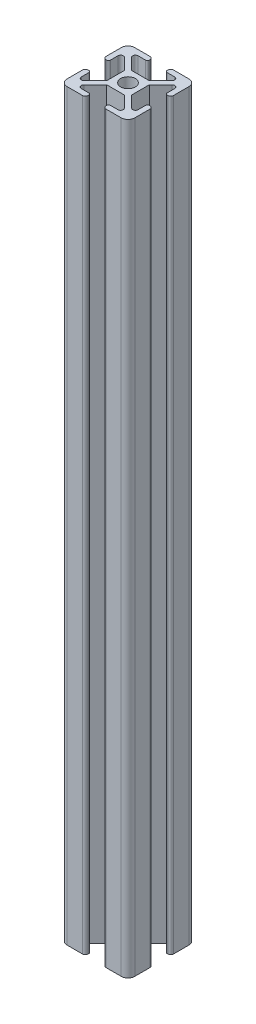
ISO-10303-21;
HEADER;
FILE_DESCRIPTION(('STEP AP214'),'2;1');
FILE_NAME('part.step','',(''),(''),'','','');
FILE_SCHEMA(('AUTOMOTIVE_DESIGN { 1 0 10303 214 1 1 1 1 }'));
ENDSEC;
DATA;
#1=APPLICATION_CONTEXT('core data for automotive mechanical design processes');
#2=APPLICATION_PROTOCOL_DEFINITION('international standard','automotive_design',2000,#1);
#3=PRODUCT_CONTEXT('',#1,'mechanical');
#4=PRODUCT('Part','Part','',(#3));
#5=PRODUCT_RELATED_PRODUCT_CATEGORY('part','',(#4));
#6=PRODUCT_DEFINITION_FORMATION('','',#4);
#7=PRODUCT_DEFINITION_CONTEXT('part definition',#1,'design');
#8=PRODUCT_DEFINITION('design','',#6,#7);
#9=PRODUCT_DEFINITION_SHAPE('','',#8);
#10=(LENGTH_UNIT() NAMED_UNIT(*) SI_UNIT(.MILLI.,.METRE.));
#11=(NAMED_UNIT(*) PLANE_ANGLE_UNIT() SI_UNIT($,.RADIAN.));
#12=(NAMED_UNIT(*) SI_UNIT($,.STERADIAN.) SOLID_ANGLE_UNIT());
#13=UNCERTAINTY_MEASURE_WITH_UNIT(LENGTH_MEASURE(1.E-05),#10,'distance_accuracy_value','');
#14=(GEOMETRIC_REPRESENTATION_CONTEXT(3) GLOBAL_UNCERTAINTY_ASSIGNED_CONTEXT((#13)) GLOBAL_UNIT_ASSIGNED_CONTEXT((#10,
#11,#12)) REPRESENTATION_CONTEXT('',''));
#15=CARTESIAN_POINT('',(0.,0.,0.));
#16=DIRECTION('',(0.,0.,1.));
#17=DIRECTION('',(1.,0.,0.));
#18=AXIS2_PLACEMENT_3D('',#15,#16,#17);
#19=CARTESIAN_POINT('',(-9.2,220.,-3.45));
#20=DIRECTION('',(0.,1.,0.));
#21=DIRECTION('',(0.,0.,1.));
#22=AXIS2_PLACEMENT_3D('',#19,#20,#21);
#23=PLANE('',#22);
#24=CARTESIAN_POINT('',(-9.2,220.,-3.45));
#25=DIRECTION('',(0.,1.,0.));
#26=DIRECTION('',(0.,0.,1.));
#27=AXIS2_PLACEMENT_3D('',#24,#25,#26);
#28=CIRCLE('',#27,0.800000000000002);
#29=CARTESIAN_POINT('',(-10.,220.,-3.45));
#30=VERTEX_POINT('',#29);
#31=CARTESIAN_POINT('',(-9.2,220.,-2.65));
#32=VERTEX_POINT('',#31);
#33=EDGE_CURVE('E596',#30,#32,#28,.T.);
#34=ORIENTED_EDGE('',*,*,#33,.T.);
#35=DIRECTION('',(1.,0.,0.));
#36=VECTOR('',#35,1.);
#37=CARTESIAN_POINT('',(-9.2,220.,-2.65));
#38=LINE('',#37,#36);
#39=CARTESIAN_POINT('',(-8.9,220.,-2.65));
#40=VERTEX_POINT('',#39);
#41=EDGE_CURVE('E264',#32,#40,#38,.T.);
#42=ORIENTED_EDGE('',*,*,#41,.T.);
#43=CARTESIAN_POINT('',(-8.9,220.,-3.15));
#44=DIRECTION('',(0.,1.,0.));
#45=DIRECTION('',(0.,0.,1.));
#46=AXIS2_PLACEMENT_3D('',#43,#44,#45);
#47=CIRCLE('',#46,0.499999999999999);
#48=CARTESIAN_POINT('',(-8.4,220.,-3.15));
#49=VERTEX_POINT('',#48);
#50=EDGE_CURVE('E779',#40,#49,#47,.T.);
#51=ORIENTED_EDGE('',*,*,#50,.T.);
#52=DIRECTION('',(0.,0.,-1.));
#53=VECTOR('',#52,1.);
#54=CARTESIAN_POINT('',(-8.4,220.,-3.15));
#55=LINE('',#54,#53);
#56=CARTESIAN_POINT('',(-8.4,220.,-5.4079689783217));
#57=VERTEX_POINT('',#56);
#58=EDGE_CURVE('E798',#49,#57,#55,.T.);
#59=ORIENTED_EDGE('',*,*,#58,.T.);
#60=CARTESIAN_POINT('',(-7.6,220.,-5.4079689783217));
#61=DIRECTION('',(0.,-1.,0.));
#62=DIRECTION('',(0.,0.,-1.));
#63=AXIS2_PLACEMENT_3D('',#60,#61,#62);
#64=CIRCLE('',#63,0.8);
#65=CARTESIAN_POINT('',(-7.03431457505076,220.,-5.97365440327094));
#66=VERTEX_POINT('',#65);
#67=EDGE_CURVE('E795',#57,#66,#64,.T.);
#68=ORIENTED_EDGE('',*,*,#67,.T.);
#69=DIRECTION('',(0.707106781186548,0.,0.707106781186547));
#70=VECTOR('',#69,1.);
#71=CARTESIAN_POINT('',(-7.03431457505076,220.,-5.97365440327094));
#72=LINE('',#71,#70);
#73=CARTESIAN_POINT('',(-3.675,220.,-2.61433982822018));
#74=VERTEX_POINT('',#73);
#75=EDGE_CURVE('E797',#66,#74,#72,.T.);
#76=ORIENTED_EDGE('',*,*,#75,.T.);
#77=DIRECTION('',(0.,0.,1.));
#78=VECTOR('',#77,1.);
#79=CARTESIAN_POINT('',(-3.675,220.,-2.61433982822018));
#80=LINE('',#79,#78);
#81=CARTESIAN_POINT('',(-3.675,220.,2.61433982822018));
#82=VERTEX_POINT('',#81);
#83=EDGE_CURVE('E800',#74,#82,#80,.T.);
#84=ORIENTED_EDGE('',*,*,#83,.T.);
#85=DIRECTION('',(-0.707106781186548,0.,0.707106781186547));
#86=VECTOR('',#85,1.);
#87=CARTESIAN_POINT('',(-7.03431457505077,220.,5.97365440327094));
#88=LINE('',#87,#86);
#89=CARTESIAN_POINT('',(-7.03431457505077,220.,5.97365440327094));
#90=VERTEX_POINT('',#89);
#91=EDGE_CURVE('E806',#82,#90,#88,.T.);
#92=ORIENTED_EDGE('',*,*,#91,.T.);
#93=CARTESIAN_POINT('',(-7.6,220.,5.4079689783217));
#94=DIRECTION('',(0.,-1.,0.));
#95=DIRECTION('',(0.,0.,1.));
#96=AXIS2_PLACEMENT_3D('',#93,#94,#95);
#97=CIRCLE('',#96,0.8);
#98=CARTESIAN_POINT('',(-8.4,220.,5.4079689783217));
#99=VERTEX_POINT('',#98);
#100=EDGE_CURVE('E808',#90,#99,#97,.T.);
#101=ORIENTED_EDGE('',*,*,#100,.T.);
#102=DIRECTION('',(0.,0.,-1.));
#103=VECTOR('',#102,1.);
#104=CARTESIAN_POINT('',(-8.4,220.,3.15));
#105=LINE('',#104,#103);
#106=CARTESIAN_POINT('',(-8.4,220.,3.15));
#107=VERTEX_POINT('',#106);
#108=EDGE_CURVE('E810',#99,#107,#105,.T.);
#109=ORIENTED_EDGE('',*,*,#108,.T.);
#110=CARTESIAN_POINT('',(-8.9,220.,3.15));
#111=DIRECTION('',(0.,1.,0.));
#112=DIRECTION('',(0.,0.,-1.));
#113=AXIS2_PLACEMENT_3D('',#110,#111,#112);
#114=CIRCLE('',#113,0.499999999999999);
#115=CARTESIAN_POINT('',(-8.9,220.,2.65));
#116=VERTEX_POINT('',#115);
#117=EDGE_CURVE('E812',#107,#116,#114,.T.);
#118=ORIENTED_EDGE('',*,*,#117,.T.);
#119=DIRECTION('',(-1.,0.,0.));
#120=VECTOR('',#119,1.);
#121=CARTESIAN_POINT('',(-9.2,220.,2.65));
#122=LINE('',#121,#120);
#123=CARTESIAN_POINT('',(-9.2,220.,2.64999999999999));
#124=VERTEX_POINT('',#123);
#125=EDGE_CURVE('E814',#116,#124,#122,.T.);
#126=ORIENTED_EDGE('',*,*,#125,.T.);
#127=CARTESIAN_POINT('',(-9.2,220.,3.45));
#128=DIRECTION('',(0.,1.,0.));
#129=DIRECTION('',(0.,0.,-1.));
#130=AXIS2_PLACEMENT_3D('',#127,#128,#129);
#131=CIRCLE('',#130,0.800000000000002);
#132=CARTESIAN_POINT('',(-10.,220.,3.45));
#133=VERTEX_POINT('',#132);
#134=EDGE_CURVE('E816',#124,#133,#131,.T.);
#135=ORIENTED_EDGE('',*,*,#134,.T.);
#136=DIRECTION('',(0.,0.,1.));
#137=VECTOR('',#136,1.);
#138=CARTESIAN_POINT('',(-10.,220.,7.99999999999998));
#139=LINE('',#138,#137);
#140=CARTESIAN_POINT('',(-10.,220.,7.99999999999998));
#141=VERTEX_POINT('',#140);
#142=EDGE_CURVE('E818',#133,#141,#139,.T.);
#143=ORIENTED_EDGE('',*,*,#142,.T.);
#144=CARTESIAN_POINT('',(-8.00000000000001,220.,7.99999999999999));
#145=DIRECTION('',(0.,1.,0.));
#146=DIRECTION('',(0.,0.,1.));
#147=AXIS2_PLACEMENT_3D('',#144,#145,#146);
#148=CIRCLE('',#147,2.);
#149=CARTESIAN_POINT('',(-7.99999999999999,220.,9.99999999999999));
#150=VERTEX_POINT('',#149);
#151=EDGE_CURVE('E820',#141,#150,#148,.T.);
#152=ORIENTED_EDGE('',*,*,#151,.T.);
#153=DIRECTION('',(1.,0.,0.));
#154=VECTOR('',#153,1.);
#155=CARTESIAN_POINT('',(-7.99999999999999,220.,9.99999999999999));
#156=LINE('',#155,#154);
#157=CARTESIAN_POINT('',(-3.45000000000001,220.,10.));
#158=VERTEX_POINT('',#157);
#159=EDGE_CURVE('E822',#150,#158,#156,.T.);
#160=ORIENTED_EDGE('',*,*,#159,.T.);
#161=CARTESIAN_POINT('',(-3.45000000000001,220.,9.2));
#162=DIRECTION('',(0.,1.,0.));
#163=DIRECTION('',(0.,0.,1.));
#164=AXIS2_PLACEMENT_3D('',#161,#162,#163);
#165=CIRCLE('',#164,0.800000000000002);
#166=CARTESIAN_POINT('',(-2.65000000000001,220.,9.2));
#167=VERTEX_POINT('',#166);
#168=EDGE_CURVE('E824',#158,#167,#165,.T.);
#169=ORIENTED_EDGE('',*,*,#168,.T.);
#170=DIRECTION('',(0.,0.,-1.));
#171=VECTOR('',#170,1.);
#172=CARTESIAN_POINT('',(-2.65000000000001,220.,9.2));
#173=LINE('',#172,#171);
#174=CARTESIAN_POINT('',(-2.65000000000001,220.,8.9));
#175=VERTEX_POINT('',#174);
#176=EDGE_CURVE('E826',#167,#175,#173,.T.);
#177=ORIENTED_EDGE('',*,*,#176,.T.);
#178=CARTESIAN_POINT('',(-3.15000000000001,220.,8.9));
#179=DIRECTION('',(0.,1.,0.));
#180=DIRECTION('',(0.,0.,1.));
#181=AXIS2_PLACEMENT_3D('',#178,#179,#180);
#182=CIRCLE('',#181,0.499999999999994);
#183=CARTESIAN_POINT('',(-3.15000000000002,220.,8.4));
#184=VERTEX_POINT('',#183);
#185=EDGE_CURVE('E828',#175,#184,#182,.T.);
#186=ORIENTED_EDGE('',*,*,#185,.T.);
#187=DIRECTION('',(-1.,0.,0.));
#188=VECTOR('',#187,1.);
#189=CARTESIAN_POINT('',(-3.15000000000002,220.,8.4));
#190=LINE('',#189,#188);
#191=CARTESIAN_POINT('',(-5.40796897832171,220.,8.4));
#192=VERTEX_POINT('',#191);
#193=EDGE_CURVE('E830',#184,#192,#190,.T.);
#194=ORIENTED_EDGE('',*,*,#193,.T.);
#195=CARTESIAN_POINT('',(-5.40796897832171,220.,7.6));
#196=DIRECTION('',(0.,-1.,0.));
#197=DIRECTION('',(0.,0.,-1.));
#198=AXIS2_PLACEMENT_3D('',#195,#196,#197);
#199=CIRCLE('',#198,0.799999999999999);
#200=CARTESIAN_POINT('',(-5.97365440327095,220.,7.03431457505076));
#201=VERTEX_POINT('',#200);
#202=EDGE_CURVE('E832',#192,#201,#199,.T.);
#203=ORIENTED_EDGE('',*,*,#202,.T.);
#204=DIRECTION('',(0.707106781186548,0.,-0.707106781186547));
#205=VECTOR('',#204,1.);
#206=CARTESIAN_POINT('',(-5.97365440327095,220.,7.03431457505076));
#207=LINE('',#206,#205);
#208=CARTESIAN_POINT('',(-2.61433982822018,220.,3.675));
#209=VERTEX_POINT('',#208);
#210=EDGE_CURVE('E834',#201,#209,#207,.T.);
#211=ORIENTED_EDGE('',*,*,#210,.T.);
#212=DIRECTION('',(1.,0.,0.));
#213=VECTOR('',#212,1.);
#214=CARTESIAN_POINT('',(-2.61433982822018,220.,3.675));
#215=LINE('',#214,#213);
#216=CARTESIAN_POINT('',(2.61433982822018,220.,3.675));
#217=VERTEX_POINT('',#216);
#218=EDGE_CURVE('E836',#209,#217,#215,.T.);
#219=ORIENTED_EDGE('',*,*,#218,.T.);
#220=DIRECTION('',(0.707106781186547,0.,0.707106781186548));
#221=VECTOR('',#220,1.);
#222=CARTESIAN_POINT('',(5.97365440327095,220.,7.03431457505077));
#223=LINE('',#222,#221);
#224=CARTESIAN_POINT('',(5.97365440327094,220.,7.03431457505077));
#225=VERTEX_POINT('',#224);
#226=EDGE_CURVE('E838',#217,#225,#223,.T.);
#227=ORIENTED_EDGE('',*,*,#226,.T.);
#228=CARTESIAN_POINT('',(5.4079689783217,220.,7.60000000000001));
#229=DIRECTION('',(0.,-1.,0.));
#230=DIRECTION('',(0.,0.,1.));
#231=AXIS2_PLACEMENT_3D('',#228,#229,#230);
#232=CIRCLE('',#231,0.799999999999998);
#233=CARTESIAN_POINT('',(5.40796897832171,220.,8.4));
#234=VERTEX_POINT('',#233);
#235=EDGE_CURVE('E840',#225,#234,#232,.T.);
#236=ORIENTED_EDGE('',*,*,#235,.T.);
#237=DIRECTION('',(-1.,0.,0.));
#238=VECTOR('',#237,1.);
#239=CARTESIAN_POINT('',(3.15000000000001,220.,8.40000000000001));
#240=LINE('',#239,#238);
#241=CARTESIAN_POINT('',(3.15,220.,8.40000000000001));
#242=VERTEX_POINT('',#241);
#243=EDGE_CURVE('E842',#234,#242,#240,.T.);
#244=ORIENTED_EDGE('',*,*,#243,.T.);
#245=CARTESIAN_POINT('',(3.15,220.,8.9));
#246=DIRECTION('',(0.,1.,0.));
#247=DIRECTION('',(0.,0.,-1.));
#248=AXIS2_PLACEMENT_3D('',#245,#246,#247);
#249=CIRCLE('',#248,0.499999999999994);
#250=CARTESIAN_POINT('',(2.65000000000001,220.,8.9));
#251=VERTEX_POINT('',#250);
#252=EDGE_CURVE('E844',#242,#251,#249,.T.);
#253=ORIENTED_EDGE('',*,*,#252,.T.);
#254=DIRECTION('',(0.,0.,1.));
#255=VECTOR('',#254,1.);
#256=CARTESIAN_POINT('',(2.65,220.,9.20000000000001));
#257=LINE('',#256,#255);
#258=CARTESIAN_POINT('',(2.65,220.,9.20000000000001));
#259=VERTEX_POINT('',#258);
#260=EDGE_CURVE('E846',#251,#259,#257,.T.);
#261=ORIENTED_EDGE('',*,*,#260,.T.);
#262=CARTESIAN_POINT('',(3.45000000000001,220.,9.2));
#263=DIRECTION('',(0.,1.,0.));
#264=DIRECTION('',(0.,0.,-1.));
#265=AXIS2_PLACEMENT_3D('',#262,#263,#264);
#266=CIRCLE('',#265,0.800000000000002);
#267=CARTESIAN_POINT('',(3.45000000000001,220.,10.));
#268=VERTEX_POINT('',#267);
#269=EDGE_CURVE('E848',#259,#268,#266,.T.);
#270=ORIENTED_EDGE('',*,*,#269,.T.);
#271=DIRECTION('',(1.,0.,0.));
#272=VECTOR('',#271,1.);
#273=CARTESIAN_POINT('',(7.99999999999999,220.,10.));
#274=LINE('',#273,#272);
#275=CARTESIAN_POINT('',(7.99999999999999,220.,10.));
#276=VERTEX_POINT('',#275);
#277=EDGE_CURVE('E850',#268,#276,#274,.T.);
#278=ORIENTED_EDGE('',*,*,#277,.T.);
#279=CARTESIAN_POINT('',(8.00000000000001,220.,8.));
#280=DIRECTION('',(0.,1.,0.));
#281=DIRECTION('',(0.,0.,-1.));
#282=AXIS2_PLACEMENT_3D('',#279,#280,#281);
#283=CIRCLE('',#282,2.);
#284=CARTESIAN_POINT('',(10.,220.,7.99999999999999));
#285=VERTEX_POINT('',#284);
#286=EDGE_CURVE('E852',#276,#285,#283,.T.);
#287=ORIENTED_EDGE('',*,*,#286,.T.);
#288=DIRECTION('',(0.,0.,-1.));
#289=VECTOR('',#288,1.);
#290=CARTESIAN_POINT('',(10.,220.,7.99999999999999));
#291=LINE('',#290,#289);
#292=CARTESIAN_POINT('',(10.,220.,3.45000000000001));
#293=VERTEX_POINT('',#292);
#294=EDGE_CURVE('E854',#285,#293,#291,.T.);
#295=ORIENTED_EDGE('',*,*,#294,.T.);
#296=CARTESIAN_POINT('',(9.2,220.,3.45000000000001));
#297=DIRECTION('',(0.,1.,0.));
#298=DIRECTION('',(0.,0.,1.));
#299=AXIS2_PLACEMENT_3D('',#296,#297,#298);
#300=CIRCLE('',#299,0.800000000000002);
#301=CARTESIAN_POINT('',(9.2,220.,2.65000000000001));
#302=VERTEX_POINT('',#301);
#303=EDGE_CURVE('E856',#293,#302,#300,.T.);
#304=ORIENTED_EDGE('',*,*,#303,.T.);
#305=DIRECTION('',(-1.,0.,0.));
#306=VECTOR('',#305,1.);
#307=CARTESIAN_POINT('',(9.2,220.,2.65000000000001));
#308=LINE('',#307,#306);
#309=CARTESIAN_POINT('',(8.9,220.,2.65000000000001));
#310=VERTEX_POINT('',#309);
#311=EDGE_CURVE('E858',#302,#310,#308,.T.);
#312=ORIENTED_EDGE('',*,*,#311,.T.);
#313=CARTESIAN_POINT('',(8.9,220.,3.15000000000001));
#314=DIRECTION('',(0.,1.,0.));
#315=DIRECTION('',(0.,0.,1.));
#316=AXIS2_PLACEMENT_3D('',#313,#314,#315);
#317=CIRCLE('',#316,0.499999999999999);
#318=CARTESIAN_POINT('',(8.40000000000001,220.,3.15000000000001));
#319=VERTEX_POINT('',#318);
#320=EDGE_CURVE('E860',#310,#319,#317,.T.);
#321=ORIENTED_EDGE('',*,*,#320,.T.);
#322=DIRECTION('',(0.,0.,1.));
#323=VECTOR('',#322,1.);
#324=CARTESIAN_POINT('',(8.40000000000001,220.,3.15000000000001));
#325=LINE('',#324,#323);
#326=CARTESIAN_POINT('',(8.4,220.,5.40796897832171));
#327=VERTEX_POINT('',#326);
#328=EDGE_CURVE('E862',#319,#327,#325,.T.);
#329=ORIENTED_EDGE('',*,*,#328,.T.);
#330=CARTESIAN_POINT('',(7.6,220.,5.40796897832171));
#331=DIRECTION('',(0.,-1.,0.));
#332=DIRECTION('',(0.,0.,-1.));
#333=AXIS2_PLACEMENT_3D('',#330,#331,#332);
#334=CIRCLE('',#333,0.800000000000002);
#335=CARTESIAN_POINT('',(7.03431457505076,220.,5.97365440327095));
#336=VERTEX_POINT('',#335);
#337=EDGE_CURVE('E864',#327,#336,#334,.T.);
#338=ORIENTED_EDGE('',*,*,#337,.T.);
#339=DIRECTION('',(-0.707106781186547,0.,-0.707106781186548));
#340=VECTOR('',#339,1.);
#341=CARTESIAN_POINT('',(7.03431457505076,220.,5.97365440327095));
#342=LINE('',#341,#340);
#343=CARTESIAN_POINT('',(3.675,220.,2.61433982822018));
#344=VERTEX_POINT('',#343);
#345=EDGE_CURVE('E866',#336,#344,#342,.T.);
#346=ORIENTED_EDGE('',*,*,#345,.T.);
#347=DIRECTION('',(0.,0.,-1.));
#348=VECTOR('',#347,1.);
#349=CARTESIAN_POINT('',(3.675,220.,-2.61433982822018));
#350=LINE('',#349,#348);
#351=CARTESIAN_POINT('',(3.675,220.,-2.61433982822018));
#352=VERTEX_POINT('',#351);
#353=EDGE_CURVE('E868',#344,#352,#350,.T.);
#354=ORIENTED_EDGE('',*,*,#353,.T.);
#355=DIRECTION('',(0.707106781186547,0.,-0.707106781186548));
#356=VECTOR('',#355,1.);
#357=CARTESIAN_POINT('',(7.03431457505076,220.,-5.97365440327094));
#358=LINE('',#357,#356);
#359=CARTESIAN_POINT('',(7.03431457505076,220.,-5.97365440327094));
#360=VERTEX_POINT('',#359);
#361=EDGE_CURVE('E870',#352,#360,#358,.T.);
#362=ORIENTED_EDGE('',*,*,#361,.T.);
#363=CARTESIAN_POINT('',(7.6,220.,-5.4079689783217));
#364=DIRECTION('',(0.,-1.,0.));
#365=DIRECTION('',(0.,0.,1.));
#366=AXIS2_PLACEMENT_3D('',#363,#364,#365);
#367=CIRCLE('',#366,0.800000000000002);
#368=CARTESIAN_POINT('',(8.4,220.,-5.4079689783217));
#369=VERTEX_POINT('',#368);
#370=EDGE_CURVE('E872',#360,#369,#367,.T.);
#371=ORIENTED_EDGE('',*,*,#370,.T.);
#372=DIRECTION('',(0.,0.,1.));
#373=VECTOR('',#372,1.);
#374=CARTESIAN_POINT('',(8.40000000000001,220.,-3.15));
#375=LINE('',#374,#373);
#376=CARTESIAN_POINT('',(8.4,220.,-3.15));
#377=VERTEX_POINT('',#376);
#378=EDGE_CURVE('E874',#369,#377,#375,.T.);
#379=ORIENTED_EDGE('',*,*,#378,.T.);
#380=CARTESIAN_POINT('',(8.9,220.,-3.15));
#381=DIRECTION('',(0.,1.,0.));
#382=DIRECTION('',(0.,0.,-1.));
#383=AXIS2_PLACEMENT_3D('',#380,#381,#382);
#384=CIRCLE('',#383,0.499999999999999);
#385=CARTESIAN_POINT('',(8.9,220.,-2.65));
#386=VERTEX_POINT('',#385);
#387=EDGE_CURVE('E876',#377,#386,#384,.T.);
#388=ORIENTED_EDGE('',*,*,#387,.T.);
#389=DIRECTION('',(1.,0.,0.));
#390=VECTOR('',#389,1.);
#391=CARTESIAN_POINT('',(9.2,220.,-2.65));
#392=LINE('',#391,#390);
#393=CARTESIAN_POINT('',(9.2,220.,-2.65));
#394=VERTEX_POINT('',#393);
#395=EDGE_CURVE('E878',#386,#394,#392,.T.);
#396=ORIENTED_EDGE('',*,*,#395,.T.);
#397=CARTESIAN_POINT('',(9.2,220.,-3.45));
#398=DIRECTION('',(0.,1.,0.));
#399=DIRECTION('',(0.,0.,-1.));
#400=AXIS2_PLACEMENT_3D('',#397,#398,#399);
#401=CIRCLE('',#400,0.800000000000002);
#402=CARTESIAN_POINT('',(10.,220.,-3.45));
#403=VERTEX_POINT('',#402);
#404=EDGE_CURVE('E880',#394,#403,#401,.T.);
#405=ORIENTED_EDGE('',*,*,#404,.T.);
#406=DIRECTION('',(0.,0.,-1.));
#407=VECTOR('',#406,1.);
#408=CARTESIAN_POINT('',(10.,220.,-7.99999999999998));
#409=LINE('',#408,#407);
#410=CARTESIAN_POINT('',(10.,220.,-7.99999999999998));
#411=VERTEX_POINT('',#410);
#412=EDGE_CURVE('E882',#403,#411,#409,.T.);
#413=ORIENTED_EDGE('',*,*,#412,.T.);
#414=CARTESIAN_POINT('',(8.00000000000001,220.,-8.));
#415=DIRECTION('',(0.,1.,0.));
#416=DIRECTION('',(0.,0.,1.));
#417=AXIS2_PLACEMENT_3D('',#414,#415,#416);
#418=CIRCLE('',#417,2.);
#419=CARTESIAN_POINT('',(7.99999999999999,220.,-10.));
#420=VERTEX_POINT('',#419);
#421=EDGE_CURVE('E884',#411,#420,#418,.T.);
#422=ORIENTED_EDGE('',*,*,#421,.T.);
#423=DIRECTION('',(-1.,0.,0.));
#424=VECTOR('',#423,1.);
#425=CARTESIAN_POINT('',(7.99999999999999,220.,-10.));
#426=LINE('',#425,#424);
#427=CARTESIAN_POINT('',(3.45000000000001,220.,-10.));
#428=VERTEX_POINT('',#427);
#429=EDGE_CURVE('E886',#420,#428,#426,.T.);
#430=ORIENTED_EDGE('',*,*,#429,.T.);
#431=CARTESIAN_POINT('',(3.45000000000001,220.,-9.2));
#432=DIRECTION('',(0.,1.,0.));
#433=DIRECTION('',(0.,0.,1.));
#434=AXIS2_PLACEMENT_3D('',#431,#432,#433);
#435=CIRCLE('',#434,0.800000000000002);
#436=CARTESIAN_POINT('',(2.65000000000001,220.,-9.2));
#437=VERTEX_POINT('',#436);
#438=EDGE_CURVE('E888',#428,#437,#435,.T.);
#439=ORIENTED_EDGE('',*,*,#438,.T.);
#440=DIRECTION('',(0.,0.,1.));
#441=VECTOR('',#440,1.);
#442=CARTESIAN_POINT('',(2.65000000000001,220.,-9.2));
#443=LINE('',#442,#441);
#444=CARTESIAN_POINT('',(2.65000000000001,220.,-8.9));
#445=VERTEX_POINT('',#444);
#446=EDGE_CURVE('E890',#437,#445,#443,.T.);
#447=ORIENTED_EDGE('',*,*,#446,.T.);
#448=CARTESIAN_POINT('',(3.15,220.,-8.9));
#449=DIRECTION('',(0.,1.,0.));
#450=DIRECTION('',(0.,0.,1.));
#451=AXIS2_PLACEMENT_3D('',#448,#449,#450);
#452=CIRCLE('',#451,0.499999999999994);
#453=CARTESIAN_POINT('',(3.15000000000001,220.,-8.4));
#454=VERTEX_POINT('',#453);
#455=EDGE_CURVE('E892',#445,#454,#452,.T.);
#456=ORIENTED_EDGE('',*,*,#455,.T.);
#457=DIRECTION('',(1.,0.,0.));
#458=VECTOR('',#457,1.);
#459=CARTESIAN_POINT('',(3.15000000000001,220.,-8.4));
#460=LINE('',#459,#458);
#461=CARTESIAN_POINT('',(5.40796897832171,220.,-8.4));
#462=VERTEX_POINT('',#461);
#463=EDGE_CURVE('E894',#454,#462,#460,.T.);
#464=ORIENTED_EDGE('',*,*,#463,.T.);
#465=CARTESIAN_POINT('',(5.40796897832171,220.,-7.6));
#466=DIRECTION('',(0.,-1.,0.));
#467=DIRECTION('',(0.,0.,-1.));
#468=AXIS2_PLACEMENT_3D('',#465,#466,#467);
#469=CIRCLE('',#468,0.799999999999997);
#470=CARTESIAN_POINT('',(5.97365440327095,220.,-7.03431457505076));
#471=VERTEX_POINT('',#470);
#472=EDGE_CURVE('E896',#462,#471,#469,.T.);
#473=ORIENTED_EDGE('',*,*,#472,.T.);
#474=DIRECTION('',(-0.707106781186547,0.,0.707106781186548));
#475=VECTOR('',#474,1.);
#476=CARTESIAN_POINT('',(5.97365440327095,220.,-7.03431457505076));
#477=LINE('',#476,#475);
#478=CARTESIAN_POINT('',(2.61433982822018,220.,-3.675));
#479=VERTEX_POINT('',#478);
#480=EDGE_CURVE('E898',#471,#479,#477,.T.);
#481=ORIENTED_EDGE('',*,*,#480,.T.);
#482=DIRECTION('',(-1.,0.,0.));
#483=VECTOR('',#482,1.);
#484=CARTESIAN_POINT('',(-2.61433982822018,220.,-3.675));
#485=LINE('',#484,#483);
#486=CARTESIAN_POINT('',(-2.61433982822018,220.,-3.675));
#487=VERTEX_POINT('',#486);
#488=EDGE_CURVE('E900',#479,#487,#485,.T.);
#489=ORIENTED_EDGE('',*,*,#488,.T.);
#490=DIRECTION('',(-0.707106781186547,0.,-0.707106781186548));
#491=VECTOR('',#490,1.);
#492=CARTESIAN_POINT('',(-5.97365440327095,220.,-7.03431457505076));
#493=LINE('',#492,#491);
#494=CARTESIAN_POINT('',(-5.97365440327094,220.,-7.03431457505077));
#495=VERTEX_POINT('',#494);
#496=EDGE_CURVE('E902',#487,#495,#493,.T.);
#497=ORIENTED_EDGE('',*,*,#496,.T.);
#498=CARTESIAN_POINT('',(-5.40796897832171,220.,-7.6));
#499=DIRECTION('',(0.,-1.,0.));
#500=DIRECTION('',(0.,0.,1.));
#501=AXIS2_PLACEMENT_3D('',#498,#499,#500);
#502=CIRCLE('',#501,0.799999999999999);
#503=CARTESIAN_POINT('',(-5.40796897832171,220.,-8.4));
#504=VERTEX_POINT('',#503);
#505=EDGE_CURVE('E904',#495,#504,#502,.T.);
#506=ORIENTED_EDGE('',*,*,#505,.T.);
#507=DIRECTION('',(1.,0.,0.));
#508=VECTOR('',#507,1.);
#509=CARTESIAN_POINT('',(-3.15000000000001,220.,-8.4));
#510=LINE('',#509,#508);
#511=CARTESIAN_POINT('',(-3.15000000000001,220.,-8.4));
#512=VERTEX_POINT('',#511);
#513=EDGE_CURVE('E906',#504,#512,#510,.T.);
#514=ORIENTED_EDGE('',*,*,#513,.T.);
#515=CARTESIAN_POINT('',(-3.15,220.,-8.9));
#516=DIRECTION('',(0.,1.,0.));
#517=DIRECTION('',(0.,0.,-1.));
#518=AXIS2_PLACEMENT_3D('',#515,#516,#517);
#519=CIRCLE('',#518,0.499999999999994);
#520=CARTESIAN_POINT('',(-2.65000000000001,220.,-8.9));
#521=VERTEX_POINT('',#520);
#522=EDGE_CURVE('E908',#512,#521,#519,.T.);
#523=ORIENTED_EDGE('',*,*,#522,.T.);
#524=DIRECTION('',(0.,0.,-1.));
#525=VECTOR('',#524,1.);
#526=CARTESIAN_POINT('',(-2.65000000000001,220.,-9.2));
#527=LINE('',#526,#525);
#528=CARTESIAN_POINT('',(-2.65000000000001,220.,-9.2));
#529=VERTEX_POINT('',#528);
#530=EDGE_CURVE('E910',#521,#529,#527,.T.);
#531=ORIENTED_EDGE('',*,*,#530,.T.);
#532=CARTESIAN_POINT('',(-3.45000000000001,220.,-9.2));
#533=DIRECTION('',(0.,1.,0.));
#534=DIRECTION('',(0.,0.,-1.));
#535=AXIS2_PLACEMENT_3D('',#532,#533,#534);
#536=CIRCLE('',#535,0.800000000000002);
#537=CARTESIAN_POINT('',(-3.45000000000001,220.,-10.));
#538=VERTEX_POINT('',#537);
#539=EDGE_CURVE('E451',#529,#538,#536,.T.);
#540=ORIENTED_EDGE('',*,*,#539,.T.);
#541=DIRECTION('',(-1.,0.,0.));
#542=VECTOR('',#541,1.);
#543=CARTESIAN_POINT('',(-7.99999999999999,220.,-10.));
#544=LINE('',#543,#542);
#545=CARTESIAN_POINT('',(-8.,220.,-10.));
#546=VERTEX_POINT('',#545);
#547=EDGE_CURVE('E445',#538,#546,#544,.T.);
#548=ORIENTED_EDGE('',*,*,#547,.T.);
#549=CARTESIAN_POINT('',(-8.,220.,-8.));
#550=DIRECTION('',(0.,1.,0.));
#551=DIRECTION('',(0.,0.,-1.));
#552=AXIS2_PLACEMENT_3D('',#549,#550,#551);
#553=CIRCLE('',#552,2.);
#554=CARTESIAN_POINT('',(-10.,220.,-7.99999999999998));
#555=VERTEX_POINT('',#554);
#556=EDGE_CURVE('E449',#546,#555,#553,.T.);
#557=ORIENTED_EDGE('',*,*,#556,.T.);
#558=DIRECTION('',(0.,0.,1.));
#559=VECTOR('',#558,1.);
#560=CARTESIAN_POINT('',(-10.,220.,-7.99999999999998));
#561=LINE('',#560,#559);
#562=EDGE_CURVE('E53',#555,#30,#561,.T.);
#563=ORIENTED_EDGE('',*,*,#562,.T.);
#564=EDGE_LOOP('',(#34,#42,#51,#59,#68,#76,#84,#92,#101,#109,#118,#126,#135,#143,#152,#160,#169,
#177,#186,#194,#203,#211,#219,#227,#236,#244,#253,#261,#270,#278,#287,#295,#304,#312,#321,#329,
#338,#346,#354,#362,#371,#379,#388,#396,#405,#413,#422,#430,#439,#447,#456,#464,#473,#481,#489,
#497,#506,#514,#523,#531,#540,#548,#557,#563));
#565=FACE_BOUND('',#564,.T.);
#566=CARTESIAN_POINT('',(0.,220.,0.));
#567=DIRECTION('',(0.,1.,0.));
#568=DIRECTION('',(0.,0.,1.));
#569=AXIS2_PLACEMENT_3D('',#566,#567,#568);
#570=CIRCLE('',#569,2.175);
#571=CARTESIAN_POINT('',(0.,220.,2.175));
#572=VERTEX_POINT('',#571);
#573=EDGE_CURVE('E473',#572,#572,#570,.T.);
#574=ORIENTED_EDGE('',*,*,#573,.F.);
#575=EDGE_LOOP('',(#574));
#576=FACE_BOUND('',#575,.T.);
#577=ADVANCED_FACE('F36',(#565,#576),#23,.T.);
#578=CARTESIAN_POINT('',(-9.2,0.,-3.45));
#579=DIRECTION('',(0.,1.,0.));
#580=DIRECTION('',(0.,0.,1.));
#581=AXIS2_PLACEMENT_3D('',#578,#579,#580);
#582=PLANE('',#581);
#583=CARTESIAN_POINT('',(-9.2,0.,-3.45));
#584=DIRECTION('',(0.,1.,0.));
#585=DIRECTION('',(0.,0.,1.));
#586=AXIS2_PLACEMENT_3D('',#583,#584,#585);
#587=CIRCLE('',#586,0.800000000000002);
#588=CARTESIAN_POINT('',(-10.,0.,-3.45));
#589=VERTEX_POINT('',#588);
#590=CARTESIAN_POINT('',(-9.2,0.,-2.65));
#591=VERTEX_POINT('',#590);
#592=EDGE_CURVE('E469',#589,#591,#587,.T.);
#593=ORIENTED_EDGE('',*,*,#592,.F.);
#594=DIRECTION('',(0.,0.,1.));
#595=VECTOR('',#594,1.);
#596=CARTESIAN_POINT('',(-10.,0.,-7.99999999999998));
#597=LINE('',#596,#595);
#598=CARTESIAN_POINT('',(-10.,0.,-7.99999999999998));
#599=VERTEX_POINT('',#598);
#600=EDGE_CURVE('E256',#599,#589,#597,.T.);
#601=ORIENTED_EDGE('',*,*,#600,.F.);
#602=CARTESIAN_POINT('',(-8.,0.,-8.));
#603=DIRECTION('',(0.,1.,0.));
#604=DIRECTION('',(0.,0.,-1.));
#605=AXIS2_PLACEMENT_3D('',#602,#603,#604);
#606=CIRCLE('',#605,2.);
#607=CARTESIAN_POINT('',(-8.,0.,-10.));
#608=VERTEX_POINT('',#607);
#609=EDGE_CURVE('E250',#608,#599,#606,.T.);
#610=ORIENTED_EDGE('',*,*,#609,.F.);
#611=DIRECTION('',(-1.,0.,0.));
#612=VECTOR('',#611,1.);
#613=CARTESIAN_POINT('',(-7.99999999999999,0.,-10.));
#614=LINE('',#613,#612);
#615=CARTESIAN_POINT('',(-3.45000000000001,0.,-10.));
#616=VERTEX_POINT('',#615);
#617=EDGE_CURVE('E459',#616,#608,#614,.T.);
#618=ORIENTED_EDGE('',*,*,#617,.F.);
#619=CARTESIAN_POINT('',(-3.45000000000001,0.,-9.2));
#620=DIRECTION('',(0.,1.,0.));
#621=DIRECTION('',(0.,0.,-1.));
#622=AXIS2_PLACEMENT_3D('',#619,#620,#621);
#623=CIRCLE('',#622,0.800000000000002);
#624=CARTESIAN_POINT('',(-2.65000000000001,0.,-9.2));
#625=VERTEX_POINT('',#624);
#626=EDGE_CURVE('E591',#625,#616,#623,.T.);
#627=ORIENTED_EDGE('',*,*,#626,.F.);
#628=DIRECTION('',(0.,0.,-1.));
#629=VECTOR('',#628,1.);
#630=CARTESIAN_POINT('',(-2.65000000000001,0.,-9.2));
#631=LINE('',#630,#629);
#632=CARTESIAN_POINT('',(-2.65000000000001,0.,-8.9));
#633=VERTEX_POINT('',#632);
#634=EDGE_CURVE('E589',#633,#625,#631,.T.);
#635=ORIENTED_EDGE('',*,*,#634,.F.);
#636=CARTESIAN_POINT('',(-3.15,0.,-8.9));
#637=DIRECTION('',(0.,1.,0.));
#638=DIRECTION('',(0.,0.,-1.));
#639=AXIS2_PLACEMENT_3D('',#636,#637,#638);
#640=CIRCLE('',#639,0.499999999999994);
#641=CARTESIAN_POINT('',(-3.15000000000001,0.,-8.4));
#642=VERTEX_POINT('',#641);
#643=EDGE_CURVE('E587',#642,#633,#640,.T.);
#644=ORIENTED_EDGE('',*,*,#643,.F.);
#645=DIRECTION('',(1.,0.,0.));
#646=VECTOR('',#645,1.);
#647=CARTESIAN_POINT('',(-3.15000000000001,0.,-8.4));
#648=LINE('',#647,#646);
#649=CARTESIAN_POINT('',(-5.40796897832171,0.,-8.4));
#650=VERTEX_POINT('',#649);
#651=EDGE_CURVE('E585',#650,#642,#648,.T.);
#652=ORIENTED_EDGE('',*,*,#651,.F.);
#653=CARTESIAN_POINT('',(-5.40796897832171,0.,-7.6));
#654=DIRECTION('',(0.,-1.,0.));
#655=DIRECTION('',(0.,0.,1.));
#656=AXIS2_PLACEMENT_3D('',#653,#654,#655);
#657=CIRCLE('',#656,0.799999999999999);
#658=CARTESIAN_POINT('',(-5.97365440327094,0.,-7.03431457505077));
#659=VERTEX_POINT('',#658);
#660=EDGE_CURVE('E583',#659,#650,#657,.T.);
#661=ORIENTED_EDGE('',*,*,#660,.F.);
#662=DIRECTION('',(-0.707106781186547,0.,-0.707106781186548));
#663=VECTOR('',#662,1.);
#664=CARTESIAN_POINT('',(-5.97365440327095,0.,-7.03431457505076));
#665=LINE('',#664,#663);
#666=CARTESIAN_POINT('',(-2.61433982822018,0.,-3.675));
#667=VERTEX_POINT('',#666);
#668=EDGE_CURVE('E581',#667,#659,#665,.T.);
#669=ORIENTED_EDGE('',*,*,#668,.F.);
#670=DIRECTION('',(-1.,0.,0.));
#671=VECTOR('',#670,1.);
#672=CARTESIAN_POINT('',(-2.61433982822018,0.,-3.675));
#673=LINE('',#672,#671);
#674=CARTESIAN_POINT('',(2.61433982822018,0.,-3.675));
#675=VERTEX_POINT('',#674);
#676=EDGE_CURVE('E579',#675,#667,#673,.T.);
#677=ORIENTED_EDGE('',*,*,#676,.F.);
#678=DIRECTION('',(-0.707106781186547,0.,0.707106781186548));
#679=VECTOR('',#678,1.);
#680=CARTESIAN_POINT('',(5.97365440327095,0.,-7.03431457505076));
#681=LINE('',#680,#679);
#682=CARTESIAN_POINT('',(5.97365440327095,0.,-7.03431457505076));
#683=VERTEX_POINT('',#682);
#684=EDGE_CURVE('E577',#683,#675,#681,.T.);
#685=ORIENTED_EDGE('',*,*,#684,.F.);
#686=CARTESIAN_POINT('',(5.40796897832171,0.,-7.6));
#687=DIRECTION('',(0.,-1.,0.));
#688=DIRECTION('',(0.,0.,-1.));
#689=AXIS2_PLACEMENT_3D('',#686,#687,#688);
#690=CIRCLE('',#689,0.799999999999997);
#691=CARTESIAN_POINT('',(5.40796897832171,0.,-8.4));
#692=VERTEX_POINT('',#691);
#693=EDGE_CURVE('E575',#692,#683,#690,.T.);
#694=ORIENTED_EDGE('',*,*,#693,.F.);
#695=DIRECTION('',(1.,0.,0.));
#696=VECTOR('',#695,1.);
#697=CARTESIAN_POINT('',(3.15000000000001,0.,-8.4));
#698=LINE('',#697,#696);
#699=CARTESIAN_POINT('',(3.15000000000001,0.,-8.4));
#700=VERTEX_POINT('',#699);
#701=EDGE_CURVE('E573',#700,#692,#698,.T.);
#702=ORIENTED_EDGE('',*,*,#701,.F.);
#703=CARTESIAN_POINT('',(3.15,0.,-8.9));
#704=DIRECTION('',(0.,1.,0.));
#705=DIRECTION('',(0.,0.,1.));
#706=AXIS2_PLACEMENT_3D('',#703,#704,#705);
#707=CIRCLE('',#706,0.499999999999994);
#708=CARTESIAN_POINT('',(2.65000000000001,0.,-8.9));
#709=VERTEX_POINT('',#708);
#710=EDGE_CURVE('E571',#709,#700,#707,.T.);
#711=ORIENTED_EDGE('',*,*,#710,.F.);
#712=DIRECTION('',(0.,0.,1.));
#713=VECTOR('',#712,1.);
#714=CARTESIAN_POINT('',(2.65000000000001,0.,-9.2));
#715=LINE('',#714,#713);
#716=CARTESIAN_POINT('',(2.65000000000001,0.,-9.2));
#717=VERTEX_POINT('',#716);
#718=EDGE_CURVE('E569',#717,#709,#715,.T.);
#719=ORIENTED_EDGE('',*,*,#718,.F.);
#720=CARTESIAN_POINT('',(3.45000000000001,0.,-9.2));
#721=DIRECTION('',(0.,1.,0.));
#722=DIRECTION('',(0.,0.,1.));
#723=AXIS2_PLACEMENT_3D('',#720,#721,#722);
#724=CIRCLE('',#723,0.800000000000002);
#725=CARTESIAN_POINT('',(3.45000000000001,0.,-10.));
#726=VERTEX_POINT('',#725);
#727=EDGE_CURVE('E567',#726,#717,#724,.T.);
#728=ORIENTED_EDGE('',*,*,#727,.F.);
#729=DIRECTION('',(-1.,0.,0.));
#730=VECTOR('',#729,1.);
#731=CARTESIAN_POINT('',(7.99999999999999,0.,-10.));
#732=LINE('',#731,#730);
#733=CARTESIAN_POINT('',(7.99999999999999,0.,-10.));
#734=VERTEX_POINT('',#733);
#735=EDGE_CURVE('E565',#734,#726,#732,.T.);
#736=ORIENTED_EDGE('',*,*,#735,.F.);
#737=CARTESIAN_POINT('',(8.00000000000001,0.,-8.));
#738=DIRECTION('',(0.,1.,0.));
#739=DIRECTION('',(0.,0.,1.));
#740=AXIS2_PLACEMENT_3D('',#737,#738,#739);
#741=CIRCLE('',#740,2.);
#742=CARTESIAN_POINT('',(10.,0.,-7.99999999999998));
#743=VERTEX_POINT('',#742);
#744=EDGE_CURVE('E563',#743,#734,#741,.T.);
#745=ORIENTED_EDGE('',*,*,#744,.F.);
#746=DIRECTION('',(0.,0.,-1.));
#747=VECTOR('',#746,1.);
#748=CARTESIAN_POINT('',(10.,0.,-7.99999999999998));
#749=LINE('',#748,#747);
#750=CARTESIAN_POINT('',(10.,0.,-3.45));
#751=VERTEX_POINT('',#750);
#752=EDGE_CURVE('E561',#751,#743,#749,.T.);
#753=ORIENTED_EDGE('',*,*,#752,.F.);
#754=CARTESIAN_POINT('',(9.2,0.,-3.45));
#755=DIRECTION('',(0.,1.,0.));
#756=DIRECTION('',(0.,0.,-1.));
#757=AXIS2_PLACEMENT_3D('',#754,#755,#756);
#758=CIRCLE('',#757,0.800000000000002);
#759=CARTESIAN_POINT('',(9.2,0.,-2.65));
#760=VERTEX_POINT('',#759);
#761=EDGE_CURVE('E559',#760,#751,#758,.T.);
#762=ORIENTED_EDGE('',*,*,#761,.F.);
#763=DIRECTION('',(1.,0.,0.));
#764=VECTOR('',#763,1.);
#765=CARTESIAN_POINT('',(9.2,0.,-2.65));
#766=LINE('',#765,#764);
#767=CARTESIAN_POINT('',(8.9,0.,-2.65));
#768=VERTEX_POINT('',#767);
#769=EDGE_CURVE('E557',#768,#760,#766,.T.);
#770=ORIENTED_EDGE('',*,*,#769,.F.);
#771=CARTESIAN_POINT('',(8.9,0.,-3.15));
#772=DIRECTION('',(0.,1.,0.));
#773=DIRECTION('',(0.,0.,-1.));
#774=AXIS2_PLACEMENT_3D('',#771,#772,#773);
#775=CIRCLE('',#774,0.499999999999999);
#776=CARTESIAN_POINT('',(8.4,0.,-3.15));
#777=VERTEX_POINT('',#776);
#778=EDGE_CURVE('E555',#777,#768,#775,.T.);
#779=ORIENTED_EDGE('',*,*,#778,.F.);
#780=DIRECTION('',(0.,0.,1.));
#781=VECTOR('',#780,1.);
#782=CARTESIAN_POINT('',(8.40000000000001,0.,-3.15));
#783=LINE('',#782,#781);
#784=CARTESIAN_POINT('',(8.4,0.,-5.4079689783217));
#785=VERTEX_POINT('',#784);
#786=EDGE_CURVE('E553',#785,#777,#783,.T.);
#787=ORIENTED_EDGE('',*,*,#786,.F.);
#788=CARTESIAN_POINT('',(7.6,0.,-5.4079689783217));
#789=DIRECTION('',(0.,-1.,0.));
#790=DIRECTION('',(0.,0.,1.));
#791=AXIS2_PLACEMENT_3D('',#788,#789,#790);
#792=CIRCLE('',#791,0.800000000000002);
#793=CARTESIAN_POINT('',(7.03431457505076,0.,-5.97365440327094));
#794=VERTEX_POINT('',#793);
#795=EDGE_CURVE('E551',#794,#785,#792,.T.);
#796=ORIENTED_EDGE('',*,*,#795,.F.);
#797=DIRECTION('',(0.707106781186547,0.,-0.707106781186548));
#798=VECTOR('',#797,1.);
#799=CARTESIAN_POINT('',(7.03431457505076,0.,-5.97365440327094));
#800=LINE('',#799,#798);
#801=CARTESIAN_POINT('',(3.675,0.,-2.61433982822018));
#802=VERTEX_POINT('',#801);
#803=EDGE_CURVE('E549',#802,#794,#800,.T.);
#804=ORIENTED_EDGE('',*,*,#803,.F.);
#805=DIRECTION('',(0.,0.,-1.));
#806=VECTOR('',#805,1.);
#807=CARTESIAN_POINT('',(3.675,0.,-2.61433982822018));
#808=LINE('',#807,#806);
#809=CARTESIAN_POINT('',(3.675,0.,2.61433982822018));
#810=VERTEX_POINT('',#809);
#811=EDGE_CURVE('E547',#810,#802,#808,.T.);
#812=ORIENTED_EDGE('',*,*,#811,.F.);
#813=DIRECTION('',(-0.707106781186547,0.,-0.707106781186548));
#814=VECTOR('',#813,1.);
#815=CARTESIAN_POINT('',(7.03431457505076,0.,5.97365440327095));
#816=LINE('',#815,#814);
#817=CARTESIAN_POINT('',(7.03431457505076,0.,5.97365440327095));
#818=VERTEX_POINT('',#817);
#819=EDGE_CURVE('E545',#818,#810,#816,.T.);
#820=ORIENTED_EDGE('',*,*,#819,.F.);
#821=CARTESIAN_POINT('',(7.6,0.,5.40796897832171));
#822=DIRECTION('',(0.,-1.,0.));
#823=DIRECTION('',(0.,0.,-1.));
#824=AXIS2_PLACEMENT_3D('',#821,#822,#823);
#825=CIRCLE('',#824,0.800000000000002);
#826=CARTESIAN_POINT('',(8.4,0.,5.40796897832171));
#827=VERTEX_POINT('',#826);
#828=EDGE_CURVE('E543',#827,#818,#825,.T.);
#829=ORIENTED_EDGE('',*,*,#828,.F.);
#830=DIRECTION('',(0.,0.,1.));
#831=VECTOR('',#830,1.);
#832=CARTESIAN_POINT('',(8.40000000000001,0.,3.15000000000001));
#833=LINE('',#832,#831);
#834=CARTESIAN_POINT('',(8.40000000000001,0.,3.15000000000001));
#835=VERTEX_POINT('',#834);
#836=EDGE_CURVE('E541',#835,#827,#833,.T.);
#837=ORIENTED_EDGE('',*,*,#836,.F.);
#838=CARTESIAN_POINT('',(8.9,0.,3.15000000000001));
#839=DIRECTION('',(0.,1.,0.));
#840=DIRECTION('',(0.,0.,1.));
#841=AXIS2_PLACEMENT_3D('',#838,#839,#840);
#842=CIRCLE('',#841,0.499999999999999);
#843=CARTESIAN_POINT('',(8.9,0.,2.65000000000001));
#844=VERTEX_POINT('',#843);
#845=EDGE_CURVE('E539',#844,#835,#842,.T.);
#846=ORIENTED_EDGE('',*,*,#845,.F.);
#847=DIRECTION('',(-1.,0.,0.));
#848=VECTOR('',#847,1.);
#849=CARTESIAN_POINT('',(9.2,0.,2.65000000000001));
#850=LINE('',#849,#848);
#851=CARTESIAN_POINT('',(9.2,0.,2.65000000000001));
#852=VERTEX_POINT('',#851);
#853=EDGE_CURVE('E537',#852,#844,#850,.T.);
#854=ORIENTED_EDGE('',*,*,#853,.F.);
#855=CARTESIAN_POINT('',(9.2,0.,3.45000000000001));
#856=DIRECTION('',(0.,1.,0.));
#857=DIRECTION('',(0.,0.,1.));
#858=AXIS2_PLACEMENT_3D('',#855,#856,#857);
#859=CIRCLE('',#858,0.800000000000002);
#860=CARTESIAN_POINT('',(10.,0.,3.45000000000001));
#861=VERTEX_POINT('',#860);
#862=EDGE_CURVE('E535',#861,#852,#859,.T.);
#863=ORIENTED_EDGE('',*,*,#862,.F.);
#864=DIRECTION('',(0.,0.,-1.));
#865=VECTOR('',#864,1.);
#866=CARTESIAN_POINT('',(10.,0.,7.99999999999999));
#867=LINE('',#866,#865);
#868=CARTESIAN_POINT('',(10.,0.,7.99999999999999));
#869=VERTEX_POINT('',#868);
#870=EDGE_CURVE('E533',#869,#861,#867,.T.);
#871=ORIENTED_EDGE('',*,*,#870,.F.);
#872=CARTESIAN_POINT('',(8.00000000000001,0.,8.));
#873=DIRECTION('',(0.,1.,0.));
#874=DIRECTION('',(0.,0.,-1.));
#875=AXIS2_PLACEMENT_3D('',#872,#873,#874);
#876=CIRCLE('',#875,2.);
#877=CARTESIAN_POINT('',(7.99999999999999,0.,10.));
#878=VERTEX_POINT('',#877);
#879=EDGE_CURVE('E531',#878,#869,#876,.T.);
#880=ORIENTED_EDGE('',*,*,#879,.F.);
#881=DIRECTION('',(1.,0.,0.));
#882=VECTOR('',#881,1.);
#883=CARTESIAN_POINT('',(7.99999999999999,0.,10.));
#884=LINE('',#883,#882);
#885=CARTESIAN_POINT('',(3.45000000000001,0.,10.));
#886=VERTEX_POINT('',#885);
#887=EDGE_CURVE('E529',#886,#878,#884,.T.);
#888=ORIENTED_EDGE('',*,*,#887,.F.);
#889=CARTESIAN_POINT('',(3.45000000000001,0.,9.2));
#890=DIRECTION('',(0.,1.,0.));
#891=DIRECTION('',(0.,0.,-1.));
#892=AXIS2_PLACEMENT_3D('',#889,#890,#891);
#893=CIRCLE('',#892,0.800000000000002);
#894=CARTESIAN_POINT('',(2.65,0.,9.20000000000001));
#895=VERTEX_POINT('',#894);
#896=EDGE_CURVE('E527',#895,#886,#893,.T.);
#897=ORIENTED_EDGE('',*,*,#896,.F.);
#898=DIRECTION('',(0.,0.,1.));
#899=VECTOR('',#898,1.);
#900=CARTESIAN_POINT('',(2.65,0.,9.20000000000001));
#901=LINE('',#900,#899);
#902=CARTESIAN_POINT('',(2.65000000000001,0.,8.9));
#903=VERTEX_POINT('',#902);
#904=EDGE_CURVE('E525',#903,#895,#901,.T.);
#905=ORIENTED_EDGE('',*,*,#904,.F.);
#906=CARTESIAN_POINT('',(3.15,0.,8.9));
#907=DIRECTION('',(0.,1.,0.));
#908=DIRECTION('',(0.,0.,-1.));
#909=AXIS2_PLACEMENT_3D('',#906,#907,#908);
#910=CIRCLE('',#909,0.499999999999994);
#911=CARTESIAN_POINT('',(3.15,0.,8.40000000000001));
#912=VERTEX_POINT('',#911);
#913=EDGE_CURVE('E523',#912,#903,#910,.T.);
#914=ORIENTED_EDGE('',*,*,#913,.F.);
#915=DIRECTION('',(-1.,0.,0.));
#916=VECTOR('',#915,1.);
#917=CARTESIAN_POINT('',(3.15000000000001,0.,8.40000000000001));
#918=LINE('',#917,#916);
#919=CARTESIAN_POINT('',(5.40796897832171,0.,8.4));
#920=VERTEX_POINT('',#919);
#921=EDGE_CURVE('E521',#920,#912,#918,.T.);
#922=ORIENTED_EDGE('',*,*,#921,.F.);
#923=CARTESIAN_POINT('',(5.4079689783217,0.,7.60000000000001));
#924=DIRECTION('',(0.,-1.,0.));
#925=DIRECTION('',(0.,0.,1.));
#926=AXIS2_PLACEMENT_3D('',#923,#924,#925);
#927=CIRCLE('',#926,0.799999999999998);
#928=CARTESIAN_POINT('',(5.97365440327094,0.,7.03431457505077));
#929=VERTEX_POINT('',#928);
#930=EDGE_CURVE('E519',#929,#920,#927,.T.);
#931=ORIENTED_EDGE('',*,*,#930,.F.);
#932=DIRECTION('',(0.707106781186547,0.,0.707106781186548));
#933=VECTOR('',#932,1.);
#934=CARTESIAN_POINT('',(5.97365440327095,0.,7.03431457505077));
#935=LINE('',#934,#933);
#936=CARTESIAN_POINT('',(2.61433982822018,0.,3.675));
#937=VERTEX_POINT('',#936);
#938=EDGE_CURVE('E517',#937,#929,#935,.T.);
#939=ORIENTED_EDGE('',*,*,#938,.F.);
#940=DIRECTION('',(1.,0.,0.));
#941=VECTOR('',#940,1.);
#942=CARTESIAN_POINT('',(-2.61433982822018,0.,3.675));
#943=LINE('',#942,#941);
#944=CARTESIAN_POINT('',(-2.61433982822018,0.,3.675));
#945=VERTEX_POINT('',#944);
#946=EDGE_CURVE('E515',#945,#937,#943,.T.);
#947=ORIENTED_EDGE('',*,*,#946,.F.);
#948=DIRECTION('',(0.707106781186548,0.,-0.707106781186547));
#949=VECTOR('',#948,1.);
#950=CARTESIAN_POINT('',(-5.97365440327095,0.,7.03431457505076));
#951=LINE('',#950,#949);
#952=CARTESIAN_POINT('',(-5.97365440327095,0.,7.03431457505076));
#953=VERTEX_POINT('',#952);
#954=EDGE_CURVE('E513',#953,#945,#951,.T.);
#955=ORIENTED_EDGE('',*,*,#954,.F.);
#956=CARTESIAN_POINT('',(-5.40796897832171,0.,7.6));
#957=DIRECTION('',(0.,-1.,0.));
#958=DIRECTION('',(0.,0.,-1.));
#959=AXIS2_PLACEMENT_3D('',#956,#957,#958);
#960=CIRCLE('',#959,0.799999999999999);
#961=CARTESIAN_POINT('',(-5.40796897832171,0.,8.4));
#962=VERTEX_POINT('',#961);
#963=EDGE_CURVE('E511',#962,#953,#960,.T.);
#964=ORIENTED_EDGE('',*,*,#963,.F.);
#965=DIRECTION('',(-1.,0.,0.));
#966=VECTOR('',#965,1.);
#967=CARTESIAN_POINT('',(-3.15000000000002,0.,8.4));
#968=LINE('',#967,#966);
#969=CARTESIAN_POINT('',(-3.15000000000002,0.,8.4));
#970=VERTEX_POINT('',#969);
#971=EDGE_CURVE('E509',#970,#962,#968,.T.);
#972=ORIENTED_EDGE('',*,*,#971,.F.);
#973=CARTESIAN_POINT('',(-3.15000000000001,0.,8.9));
#974=DIRECTION('',(0.,1.,0.));
#975=DIRECTION('',(0.,0.,1.));
#976=AXIS2_PLACEMENT_3D('',#973,#974,#975);
#977=CIRCLE('',#976,0.499999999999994);
#978=CARTESIAN_POINT('',(-2.65000000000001,0.,8.9));
#979=VERTEX_POINT('',#978);
#980=EDGE_CURVE('E507',#979,#970,#977,.T.);
#981=ORIENTED_EDGE('',*,*,#980,.F.);
#982=DIRECTION('',(0.,0.,-1.));
#983=VECTOR('',#982,1.);
#984=CARTESIAN_POINT('',(-2.65000000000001,0.,9.2));
#985=LINE('',#984,#983);
#986=CARTESIAN_POINT('',(-2.65000000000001,0.,9.2));
#987=VERTEX_POINT('',#986);
#988=EDGE_CURVE('E505',#987,#979,#985,.T.);
#989=ORIENTED_EDGE('',*,*,#988,.F.);
#990=CARTESIAN_POINT('',(-3.45000000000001,0.,9.2));
#991=DIRECTION('',(0.,1.,0.));
#992=DIRECTION('',(0.,0.,1.));
#993=AXIS2_PLACEMENT_3D('',#990,#991,#992);
#994=CIRCLE('',#993,0.800000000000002);
#995=CARTESIAN_POINT('',(-3.45000000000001,0.,10.));
#996=VERTEX_POINT('',#995);
#997=EDGE_CURVE('E503',#996,#987,#994,.T.);
#998=ORIENTED_EDGE('',*,*,#997,.F.);
#999=DIRECTION('',(1.,0.,0.));
#1000=VECTOR('',#999,1.);
#1001=CARTESIAN_POINT('',(-7.99999999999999,0.,9.99999999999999));
#1002=LINE('',#1001,#1000);
#1003=CARTESIAN_POINT('',(-7.99999999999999,0.,9.99999999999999));
#1004=VERTEX_POINT('',#1003);
#1005=EDGE_CURVE('E501',#1004,#996,#1002,.T.);
#1006=ORIENTED_EDGE('',*,*,#1005,.F.);
#1007=CARTESIAN_POINT('',(-8.00000000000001,0.,7.99999999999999));
#1008=DIRECTION('',(0.,1.,0.));
#1009=DIRECTION('',(0.,0.,1.));
#1010=AXIS2_PLACEMENT_3D('',#1007,#1008,#1009);
#1011=CIRCLE('',#1010,2.);
#1012=CARTESIAN_POINT('',(-10.,0.,7.99999999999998));
#1013=VERTEX_POINT('',#1012);
#1014=EDGE_CURVE('E499',#1013,#1004,#1011,.T.);
#1015=ORIENTED_EDGE('',*,*,#1014,.F.);
#1016=DIRECTION('',(0.,0.,1.));
#1017=VECTOR('',#1016,1.);
#1018=CARTESIAN_POINT('',(-10.,0.,7.99999999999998));
#1019=LINE('',#1018,#1017);
#1020=CARTESIAN_POINT('',(-10.,0.,3.45));
#1021=VERTEX_POINT('',#1020);
#1022=EDGE_CURVE('E497',#1021,#1013,#1019,.T.);
#1023=ORIENTED_EDGE('',*,*,#1022,.F.);
#1024=CARTESIAN_POINT('',(-9.2,0.,3.45));
#1025=DIRECTION('',(0.,1.,0.));
#1026=DIRECTION('',(0.,0.,-1.));
#1027=AXIS2_PLACEMENT_3D('',#1024,#1025,#1026);
#1028=CIRCLE('',#1027,0.800000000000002);
#1029=CARTESIAN_POINT('',(-9.2,0.,2.64999999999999));
#1030=VERTEX_POINT('',#1029);
#1031=EDGE_CURVE('E495',#1030,#1021,#1028,.T.);
#1032=ORIENTED_EDGE('',*,*,#1031,.F.);
#1033=DIRECTION('',(-1.,0.,0.));
#1034=VECTOR('',#1033,1.);
#1035=CARTESIAN_POINT('',(-9.2,0.,2.65));
#1036=LINE('',#1035,#1034);
#1037=CARTESIAN_POINT('',(-8.9,0.,2.65));
#1038=VERTEX_POINT('',#1037);
#1039=EDGE_CURVE('E493',#1038,#1030,#1036,.T.);
#1040=ORIENTED_EDGE('',*,*,#1039,.F.);
#1041=CARTESIAN_POINT('',(-8.9,0.,3.15));
#1042=DIRECTION('',(0.,1.,0.));
#1043=DIRECTION('',(0.,0.,-1.));
#1044=AXIS2_PLACEMENT_3D('',#1041,#1042,#1043);
#1045=CIRCLE('',#1044,0.499999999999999);
#1046=CARTESIAN_POINT('',(-8.4,0.,3.15));
#1047=VERTEX_POINT('',#1046);
#1048=EDGE_CURVE('E491',#1047,#1038,#1045,.T.);
#1049=ORIENTED_EDGE('',*,*,#1048,.F.);
#1050=DIRECTION('',(0.,0.,-1.));
#1051=VECTOR('',#1050,1.);
#1052=CARTESIAN_POINT('',(-8.4,0.,3.15));
#1053=LINE('',#1052,#1051);
#1054=CARTESIAN_POINT('',(-8.4,0.,5.4079689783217));
#1055=VERTEX_POINT('',#1054);
#1056=EDGE_CURVE('E489',#1055,#1047,#1053,.T.);
#1057=ORIENTED_EDGE('',*,*,#1056,.F.);
#1058=CARTESIAN_POINT('',(-7.6,0.,5.4079689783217));
#1059=DIRECTION('',(0.,-1.,0.));
#1060=DIRECTION('',(0.,0.,1.));
#1061=AXIS2_PLACEMENT_3D('',#1058,#1059,#1060);
#1062=CIRCLE('',#1061,0.8);
#1063=CARTESIAN_POINT('',(-7.03431457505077,0.,5.97365440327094));
#1064=VERTEX_POINT('',#1063);
#1065=EDGE_CURVE('E487',#1064,#1055,#1062,.T.);
#1066=ORIENTED_EDGE('',*,*,#1065,.F.);
#1067=DIRECTION('',(-0.707106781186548,0.,0.707106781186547));
#1068=VECTOR('',#1067,1.);
#1069=CARTESIAN_POINT('',(-7.03431457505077,0.,5.97365440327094));
#1070=LINE('',#1069,#1068);
#1071=CARTESIAN_POINT('',(-3.675,0.,2.61433982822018));
#1072=VERTEX_POINT('',#1071);
#1073=EDGE_CURVE('E485',#1072,#1064,#1070,.T.);
#1074=ORIENTED_EDGE('',*,*,#1073,.F.);
#1075=DIRECTION('',(0.,0.,1.));
#1076=VECTOR('',#1075,1.);
#1077=CARTESIAN_POINT('',(-3.675,0.,-2.61433982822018));
#1078=LINE('',#1077,#1076);
#1079=CARTESIAN_POINT('',(-3.675,0.,-2.61433982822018));
#1080=VERTEX_POINT('',#1079);
#1081=EDGE_CURVE('E483',#1080,#1072,#1078,.T.);
#1082=ORIENTED_EDGE('',*,*,#1081,.F.);
#1083=DIRECTION('',(0.707106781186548,0.,0.707106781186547));
#1084=VECTOR('',#1083,1.);
#1085=CARTESIAN_POINT('',(-7.03431457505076,0.,-5.97365440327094));
#1086=LINE('',#1085,#1084);
#1087=CARTESIAN_POINT('',(-7.03431457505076,0.,-5.97365440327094));
#1088=VERTEX_POINT('',#1087);
#1089=EDGE_CURVE('E481',#1088,#1080,#1086,.T.);
#1090=ORIENTED_EDGE('',*,*,#1089,.F.);
#1091=CARTESIAN_POINT('',(-7.6,0.,-5.4079689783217));
#1092=DIRECTION('',(0.,-1.,0.));
#1093=DIRECTION('',(0.,0.,-1.));
#1094=AXIS2_PLACEMENT_3D('',#1091,#1092,#1093);
#1095=CIRCLE('',#1094,0.8);
#1096=CARTESIAN_POINT('',(-8.4,0.,-5.4079689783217));
#1097=VERTEX_POINT('',#1096);
#1098=EDGE_CURVE('E479',#1097,#1088,#1095,.T.);
#1099=ORIENTED_EDGE('',*,*,#1098,.F.);
#1100=DIRECTION('',(0.,0.,-1.));
#1101=VECTOR('',#1100,1.);
#1102=CARTESIAN_POINT('',(-8.4,0.,-3.15));
#1103=LINE('',#1102,#1101);
#1104=CARTESIAN_POINT('',(-8.4,0.,-3.15));
#1105=VERTEX_POINT('',#1104);
#1106=EDGE_CURVE('E477',#1105,#1097,#1103,.T.);
#1107=ORIENTED_EDGE('',*,*,#1106,.F.);
#1108=CARTESIAN_POINT('',(-8.9,0.,-3.15));
#1109=DIRECTION('',(0.,1.,0.));
#1110=DIRECTION('',(0.,0.,1.));
#1111=AXIS2_PLACEMENT_3D('',#1108,#1109,#1110);
#1112=CIRCLE('',#1111,0.499999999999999);
#1113=CARTESIAN_POINT('',(-8.9,0.,-2.65));
#1114=VERTEX_POINT('',#1113);
#1115=EDGE_CURVE('E475',#1114,#1105,#1112,.T.);
#1116=ORIENTED_EDGE('',*,*,#1115,.F.);
#1117=DIRECTION('',(1.,0.,0.));
#1118=VECTOR('',#1117,1.);
#1119=CARTESIAN_POINT('',(-9.2,0.,-2.65));
#1120=LINE('',#1119,#1118);
#1121=EDGE_CURVE('E472',#591,#1114,#1120,.T.);
#1122=ORIENTED_EDGE('',*,*,#1121,.F.);
#1123=EDGE_LOOP('',(#593,#601,#610,#618,#627,#635,#644,#652,#661,#669,#677,#685,#694,#702,#711,
#719,#728,#736,#745,#753,#762,#770,#779,#787,#796,#804,#812,#820,#829,#837,#846,#854,#863,#871,
#880,#888,#897,#905,#914,#922,#931,#939,#947,#955,#964,#972,#981,#989,#998,#1006,#1015,#1023,
#1032,#1040,#1049,#1057,#1066,#1074,#1082,#1090,#1099,#1107,#1116,#1122));
#1124=FACE_BOUND('',#1123,.T.);
#1125=CARTESIAN_POINT('',(0.,0.,0.));
#1126=DIRECTION('',(0.,1.,0.));
#1127=DIRECTION('',(0.,0.,1.));
#1128=AXIS2_PLACEMENT_3D('',#1125,#1126,#1127);
#1129=CIRCLE('',#1128,2.175);
#1130=CARTESIAN_POINT('',(0.,0.,2.175));
#1131=VERTEX_POINT('',#1130);
#1132=EDGE_CURVE('E1867',#1131,#1131,#1129,.T.);
#1133=ORIENTED_EDGE('',*,*,#1132,.T.);
#1134=EDGE_LOOP('',(#1133));
#1135=FACE_BOUND('',#1134,.T.);
#1136=ADVANCED_FACE('F783',(#1124,#1135),#582,.F.);
#1137=CARTESIAN_POINT('',(-9.2,220.,-3.45));
#1138=DIRECTION('',(0.,-1.,0.));
#1139=DIRECTION('',(0.,0.,-1.));
#1140=AXIS2_PLACEMENT_3D('',#1137,#1138,#1139);
#1141=CYLINDRICAL_SURFACE('',#1140,0.800000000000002);
#1142=ORIENTED_EDGE('',*,*,#592,.T.);
#1143=DIRECTION('',(0.,-1.,0.));
#1144=VECTOR('',#1143,1.);
#1145=CARTESIAN_POINT('',(-9.2,220.,-2.65));
#1146=LINE('',#1145,#1144);
#1147=EDGE_CURVE('E11',#32,#591,#1146,.T.);
#1148=ORIENTED_EDGE('',*,*,#1147,.F.);
#1149=ORIENTED_EDGE('',*,*,#33,.F.);
#1150=DIRECTION('',(0.,-1.,0.));
#1151=VECTOR('',#1150,1.);
#1152=CARTESIAN_POINT('',(-10.,220.,-3.45));
#1153=LINE('',#1152,#1151);
#1154=EDGE_CURVE('E465',#30,#589,#1153,.T.);
#1155=ORIENTED_EDGE('',*,*,#1154,.T.);
#1156=EDGE_LOOP('',(#1142,#1148,#1149,#1155));
#1157=FACE_BOUND('',#1156,.T.);
#1158=ADVANCED_FACE('F38',(#1157),#1141,.T.);
#1159=CARTESIAN_POINT('',(-9.2,220.,-2.65));
#1160=DIRECTION('',(0.,0.,-1.));
#1161=DIRECTION('',(-1.,0.,0.));
#1162=AXIS2_PLACEMENT_3D('',#1159,#1160,#1161);
#1163=PLANE('',#1162);
#1164=ORIENTED_EDGE('',*,*,#1121,.T.);
#1165=DIRECTION('',(0.,-1.,0.));
#1166=VECTOR('',#1165,1.);
#1167=CARTESIAN_POINT('',(-8.9,220.,-2.65));
#1168=LINE('',#1167,#1166);
#1169=EDGE_CURVE('E45',#40,#1114,#1168,.T.);
#1170=ORIENTED_EDGE('',*,*,#1169,.F.);
#1171=ORIENTED_EDGE('',*,*,#41,.F.);
#1172=ORIENTED_EDGE('',*,*,#1147,.T.);
#1173=EDGE_LOOP('',(#1164,#1170,#1171,#1172));
#1174=FACE_BOUND('',#1173,.T.);
#1175=ADVANCED_FACE('F944',(#1174),#1163,.F.);
#1176=CARTESIAN_POINT('',(-8.9,220.,-3.15));
#1177=DIRECTION('',(0.,-1.,0.));
#1178=DIRECTION('',(0.,0.,-1.));
#1179=AXIS2_PLACEMENT_3D('',#1176,#1177,#1178);
#1180=CYLINDRICAL_SURFACE('',#1179,0.499999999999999);
#1181=ORIENTED_EDGE('',*,*,#1115,.T.);
#1182=DIRECTION('',(0.,-1.,0.));
#1183=VECTOR('',#1182,1.);
#1184=CARTESIAN_POINT('',(-8.4,220.,-3.15));
#1185=LINE('',#1184,#1183);
#1186=EDGE_CURVE('E771',#49,#1105,#1185,.T.);
#1187=ORIENTED_EDGE('',*,*,#1186,.F.);
#1188=ORIENTED_EDGE('',*,*,#50,.F.);
#1189=ORIENTED_EDGE('',*,*,#1169,.T.);
#1190=EDGE_LOOP('',(#1181,#1187,#1188,#1189));
#1191=FACE_BOUND('',#1190,.T.);
#1192=ADVANCED_FACE('F777',(#1191),#1180,.T.);
#1193=CARTESIAN_POINT('',(-8.4,220.,-3.15));
#1194=DIRECTION('',(-1.,0.,0.));
#1195=DIRECTION('',(0.,0.,1.));
#1196=AXIS2_PLACEMENT_3D('',#1193,#1194,#1195);
#1197=PLANE('',#1196);
#1198=ORIENTED_EDGE('',*,*,#1106,.T.);
#1199=DIRECTION('',(0.,-1.,0.));
#1200=VECTOR('',#1199,1.);
#1201=CARTESIAN_POINT('',(-8.4,220.,-5.4079689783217));
#1202=LINE('',#1201,#1200);
#1203=EDGE_CURVE('E768',#57,#1097,#1202,.T.);
#1204=ORIENTED_EDGE('',*,*,#1203,.F.);
#1205=ORIENTED_EDGE('',*,*,#58,.F.);
#1206=ORIENTED_EDGE('',*,*,#1186,.T.);
#1207=EDGE_LOOP('',(#1198,#1204,#1205,#1206));
#1208=FACE_BOUND('',#1207,.T.);
#1209=ADVANCED_FACE('F789',(#1208),#1197,.F.);
#1210=CARTESIAN_POINT('',(-7.6,220.,-5.4079689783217));
#1211=DIRECTION('',(0.,-1.,0.));
#1212=DIRECTION('',(0.,0.,-1.));
#1213=AXIS2_PLACEMENT_3D('',#1210,#1211,#1212);
#1214=CYLINDRICAL_SURFACE('',#1213,0.8);
#1215=ORIENTED_EDGE('',*,*,#1098,.T.);
#1216=DIRECTION('',(0.,-1.,0.));
#1217=VECTOR('',#1216,1.);
#1218=CARTESIAN_POINT('',(-7.03431457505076,220.,-5.97365440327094));
#1219=LINE('',#1218,#1217);
#1220=EDGE_CURVE('E765',#66,#1088,#1219,.T.);
#1221=ORIENTED_EDGE('',*,*,#1220,.F.);
#1222=ORIENTED_EDGE('',*,*,#67,.F.);
#1223=ORIENTED_EDGE('',*,*,#1203,.T.);
#1224=EDGE_LOOP('',(#1215,#1221,#1222,#1223));
#1225=FACE_BOUND('',#1224,.T.);
#1226=ADVANCED_FACE('F793',(#1225),#1214,.F.);
#1227=CARTESIAN_POINT('',(-7.03431457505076,220.,-5.97365440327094));
#1228=DIRECTION('',(0.707106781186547,0.,-0.707106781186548));
#1229=DIRECTION('',(-0.707106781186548,0.,-0.707106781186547));
#1230=AXIS2_PLACEMENT_3D('',#1227,#1228,#1229);
#1231=PLANE('',#1230);
#1232=ORIENTED_EDGE('',*,*,#1089,.T.);
#1233=DIRECTION('',(0.,-1.,0.));
#1234=VECTOR('',#1233,1.);
#1235=CARTESIAN_POINT('',(-3.675,220.,-2.61433982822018));
#1236=LINE('',#1235,#1234);
#1237=EDGE_CURVE('E762',#74,#1080,#1236,.T.);
#1238=ORIENTED_EDGE('',*,*,#1237,.F.);
#1239=ORIENTED_EDGE('',*,*,#75,.F.);
#1240=ORIENTED_EDGE('',*,*,#1220,.T.);
#1241=EDGE_LOOP('',(#1232,#1238,#1239,#1240));
#1242=FACE_BOUND('',#1241,.T.);
#1243=ADVANCED_FACE('F957',(#1242),#1231,.F.);
#1244=CARTESIAN_POINT('',(-3.675,220.,-2.61433982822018));
#1245=DIRECTION('',(1.,0.,0.));
#1246=DIRECTION('',(0.,0.,-1.));
#1247=AXIS2_PLACEMENT_3D('',#1244,#1245,#1246);
#1248=PLANE('',#1247);
#1249=ORIENTED_EDGE('',*,*,#1081,.T.);
#1250=DIRECTION('',(0.,-1.,0.));
#1251=VECTOR('',#1250,1.);
#1252=CARTESIAN_POINT('',(-3.675,220.,2.61433982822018));
#1253=LINE('',#1252,#1251);
#1254=EDGE_CURVE('E759',#82,#1072,#1253,.T.);
#1255=ORIENTED_EDGE('',*,*,#1254,.F.);
#1256=ORIENTED_EDGE('',*,*,#83,.F.);
#1257=ORIENTED_EDGE('',*,*,#1237,.T.);
#1258=EDGE_LOOP('',(#1249,#1255,#1256,#1257));
#1259=FACE_BOUND('',#1258,.T.);
#1260=ADVANCED_FACE('F960',(#1259),#1248,.F.);
#1261=CARTESIAN_POINT('',(-7.03431457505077,220.,5.97365440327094));
#1262=DIRECTION('',(0.707106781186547,0.,0.707106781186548));
#1263=DIRECTION('',(0.707106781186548,0.,-0.707106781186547));
#1264=AXIS2_PLACEMENT_3D('',#1261,#1262,#1263);
#1265=PLANE('',#1264);
#1266=ORIENTED_EDGE('',*,*,#1073,.T.);
#1267=DIRECTION('',(0.,-1.,0.));
#1268=VECTOR('',#1267,1.);
#1269=CARTESIAN_POINT('',(-7.03431457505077,220.,5.97365440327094));
#1270=LINE('',#1269,#1268);
#1271=EDGE_CURVE('E756',#90,#1064,#1270,.T.);
#1272=ORIENTED_EDGE('',*,*,#1271,.F.);
#1273=ORIENTED_EDGE('',*,*,#91,.F.);
#1274=ORIENTED_EDGE('',*,*,#1254,.T.);
#1275=EDGE_LOOP('',(#1266,#1272,#1273,#1274));
#1276=FACE_BOUND('',#1275,.T.);
#1277=ADVANCED_FACE('F964',(#1276),#1265,.F.);
#1278=CARTESIAN_POINT('',(-7.6,220.,5.4079689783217));
#1279=DIRECTION('',(0.,-1.,0.));
#1280=DIRECTION('',(0.,0.,-1.));
#1281=AXIS2_PLACEMENT_3D('',#1278,#1279,#1280);
#1282=CYLINDRICAL_SURFACE('',#1281,0.8);
#1283=ORIENTED_EDGE('',*,*,#1065,.T.);
#1284=DIRECTION('',(0.,-1.,0.));
#1285=VECTOR('',#1284,1.);
#1286=CARTESIAN_POINT('',(-8.4,220.,5.4079689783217));
#1287=LINE('',#1286,#1285);
#1288=EDGE_CURVE('E753',#99,#1055,#1287,.T.);
#1289=ORIENTED_EDGE('',*,*,#1288,.F.);
#1290=ORIENTED_EDGE('',*,*,#100,.F.);
#1291=ORIENTED_EDGE('',*,*,#1271,.T.);
#1292=EDGE_LOOP('',(#1283,#1289,#1290,#1291));
#1293=FACE_BOUND('',#1292,.T.);
#1294=ADVANCED_FACE('F968',(#1293),#1282,.F.);
#1295=CARTESIAN_POINT('',(-8.4,220.,3.15));
#1296=DIRECTION('',(-1.,0.,0.));
#1297=DIRECTION('',(0.,0.,1.));
#1298=AXIS2_PLACEMENT_3D('',#1295,#1296,#1297);
#1299=PLANE('',#1298);
#1300=ORIENTED_EDGE('',*,*,#1056,.T.);
#1301=DIRECTION('',(0.,-1.,0.));
#1302=VECTOR('',#1301,1.);
#1303=CARTESIAN_POINT('',(-8.4,220.,3.15));
#1304=LINE('',#1303,#1302);
#1305=EDGE_CURVE('E750',#107,#1047,#1304,.T.);
#1306=ORIENTED_EDGE('',*,*,#1305,.F.);
#1307=ORIENTED_EDGE('',*,*,#108,.F.);
#1308=ORIENTED_EDGE('',*,*,#1288,.T.);
#1309=EDGE_LOOP('',(#1300,#1306,#1307,#1308));
#1310=FACE_BOUND('',#1309,.T.);
#1311=ADVANCED_FACE('F972',(#1310),#1299,.F.);
#1312=CARTESIAN_POINT('',(-8.9,220.,3.15));
#1313=DIRECTION('',(0.,-1.,0.));
#1314=DIRECTION('',(0.,0.,-1.));
#1315=AXIS2_PLACEMENT_3D('',#1312,#1313,#1314);
#1316=CYLINDRICAL_SURFACE('',#1315,0.499999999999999);
#1317=ORIENTED_EDGE('',*,*,#1048,.T.);
#1318=DIRECTION('',(0.,-1.,0.));
#1319=VECTOR('',#1318,1.);
#1320=CARTESIAN_POINT('',(-8.9,220.,2.65));
#1321=LINE('',#1320,#1319);
#1322=EDGE_CURVE('E747',#116,#1038,#1321,.T.);
#1323=ORIENTED_EDGE('',*,*,#1322,.F.);
#1324=ORIENTED_EDGE('',*,*,#117,.F.);
#1325=ORIENTED_EDGE('',*,*,#1305,.T.);
#1326=EDGE_LOOP('',(#1317,#1323,#1324,#1325));
#1327=FACE_BOUND('',#1326,.T.);
#1328=ADVANCED_FACE('F976',(#1327),#1316,.T.);
#1329=CARTESIAN_POINT('',(-9.2,220.,2.65));
#1330=DIRECTION('',(0.,0.,1.));
#1331=DIRECTION('',(1.,0.,0.));
#1332=AXIS2_PLACEMENT_3D('',#1329,#1330,#1331);
#1333=PLANE('',#1332);
#1334=ORIENTED_EDGE('',*,*,#1039,.T.);
#1335=DIRECTION('',(0.,-1.,0.));
#1336=VECTOR('',#1335,1.);
#1337=CARTESIAN_POINT('',(-9.2,220.,2.64999999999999));
#1338=LINE('',#1337,#1336);
#1339=EDGE_CURVE('E744',#124,#1030,#1338,.T.);
#1340=ORIENTED_EDGE('',*,*,#1339,.F.);
#1341=ORIENTED_EDGE('',*,*,#125,.F.);
#1342=ORIENTED_EDGE('',*,*,#1322,.T.);
#1343=EDGE_LOOP('',(#1334,#1340,#1341,#1342));
#1344=FACE_BOUND('',#1343,.T.);
#1345=ADVANCED_FACE('F980',(#1344),#1333,.F.);
#1346=CARTESIAN_POINT('',(-9.2,220.,3.45));
#1347=DIRECTION('',(0.,-1.,0.));
#1348=DIRECTION('',(0.,0.,-1.));
#1349=AXIS2_PLACEMENT_3D('',#1346,#1347,#1348);
#1350=CYLINDRICAL_SURFACE('',#1349,0.800000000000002);
#1351=ORIENTED_EDGE('',*,*,#1031,.T.);
#1352=DIRECTION('',(0.,-1.,0.));
#1353=VECTOR('',#1352,1.);
#1354=CARTESIAN_POINT('',(-10.,220.,3.45));
#1355=LINE('',#1354,#1353);
#1356=EDGE_CURVE('E741',#133,#1021,#1355,.T.);
#1357=ORIENTED_EDGE('',*,*,#1356,.F.);
#1358=ORIENTED_EDGE('',*,*,#134,.F.);
#1359=ORIENTED_EDGE('',*,*,#1339,.T.);
#1360=EDGE_LOOP('',(#1351,#1357,#1358,#1359));
#1361=FACE_BOUND('',#1360,.T.);
#1362=ADVANCED_FACE('F984',(#1361),#1350,.T.);
#1363=CARTESIAN_POINT('',(-10.,220.,7.99999999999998));
#1364=DIRECTION('',(1.,0.,0.));
#1365=DIRECTION('',(0.,0.,-1.));
#1366=AXIS2_PLACEMENT_3D('',#1363,#1364,#1365);
#1367=PLANE('',#1366);
#1368=ORIENTED_EDGE('',*,*,#1022,.T.);
#1369=DIRECTION('',(0.,-1.,0.));
#1370=VECTOR('',#1369,1.);
#1371=CARTESIAN_POINT('',(-10.,220.,7.99999999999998));
#1372=LINE('',#1371,#1370);
#1373=EDGE_CURVE('E738',#141,#1013,#1372,.T.);
#1374=ORIENTED_EDGE('',*,*,#1373,.F.);
#1375=ORIENTED_EDGE('',*,*,#142,.F.);
#1376=ORIENTED_EDGE('',*,*,#1356,.T.);
#1377=EDGE_LOOP('',(#1368,#1374,#1375,#1376));
#1378=FACE_BOUND('',#1377,.T.);
#1379=ADVANCED_FACE('F988',(#1378),#1367,.F.);
#1380=CARTESIAN_POINT('',(-8.00000000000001,220.,7.99999999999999));
#1381=DIRECTION('',(0.,-1.,0.));
#1382=DIRECTION('',(0.,0.,-1.));
#1383=AXIS2_PLACEMENT_3D('',#1380,#1381,#1382);
#1384=CYLINDRICAL_SURFACE('',#1383,2.);
#1385=ORIENTED_EDGE('',*,*,#1014,.T.);
#1386=DIRECTION('',(0.,-1.,0.));
#1387=VECTOR('',#1386,1.);
#1388=CARTESIAN_POINT('',(-7.99999999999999,220.,9.99999999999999));
#1389=LINE('',#1388,#1387);
#1390=EDGE_CURVE('E735',#150,#1004,#1389,.T.);
#1391=ORIENTED_EDGE('',*,*,#1390,.F.);
#1392=ORIENTED_EDGE('',*,*,#151,.F.);
#1393=ORIENTED_EDGE('',*,*,#1373,.T.);
#1394=EDGE_LOOP('',(#1385,#1391,#1392,#1393));
#1395=FACE_BOUND('',#1394,.T.);
#1396=ADVANCED_FACE('F992',(#1395),#1384,.T.);
#1397=CARTESIAN_POINT('',(-7.99999999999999,220.,9.99999999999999));
#1398=DIRECTION('',(0.,0.,-1.));
#1399=DIRECTION('',(-1.,0.,0.));
#1400=AXIS2_PLACEMENT_3D('',#1397,#1398,#1399);
#1401=PLANE('',#1400);
#1402=ORIENTED_EDGE('',*,*,#1005,.T.);
#1403=DIRECTION('',(0.,-1.,0.));
#1404=VECTOR('',#1403,1.);
#1405=CARTESIAN_POINT('',(-3.45000000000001,220.,10.));
#1406=LINE('',#1405,#1404);
#1407=EDGE_CURVE('E732',#158,#996,#1406,.T.);
#1408=ORIENTED_EDGE('',*,*,#1407,.F.);
#1409=ORIENTED_EDGE('',*,*,#159,.F.);
#1410=ORIENTED_EDGE('',*,*,#1390,.T.);
#1411=EDGE_LOOP('',(#1402,#1408,#1409,#1410));
#1412=FACE_BOUND('',#1411,.T.);
#1413=ADVANCED_FACE('F996',(#1412),#1401,.F.);
#1414=CARTESIAN_POINT('',(-3.45000000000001,220.,9.2));
#1415=DIRECTION('',(0.,-1.,0.));
#1416=DIRECTION('',(0.,0.,-1.));
#1417=AXIS2_PLACEMENT_3D('',#1414,#1415,#1416);
#1418=CYLINDRICAL_SURFACE('',#1417,0.800000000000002);
#1419=ORIENTED_EDGE('',*,*,#997,.T.);
#1420=DIRECTION('',(0.,-1.,0.));
#1421=VECTOR('',#1420,1.);
#1422=CARTESIAN_POINT('',(-2.65000000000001,220.,9.2));
#1423=LINE('',#1422,#1421);
#1424=EDGE_CURVE('E729',#167,#987,#1423,.T.);
#1425=ORIENTED_EDGE('',*,*,#1424,.F.);
#1426=ORIENTED_EDGE('',*,*,#168,.F.);
#1427=ORIENTED_EDGE('',*,*,#1407,.T.);
#1428=EDGE_LOOP('',(#1419,#1425,#1426,#1427));
#1429=FACE_BOUND('',#1428,.T.);
#1430=ADVANCED_FACE('F1000',(#1429),#1418,.T.);
#1431=CARTESIAN_POINT('',(-2.65000000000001,220.,9.2));
#1432=DIRECTION('',(-1.,0.,0.));
#1433=DIRECTION('',(0.,0.,1.));
#1434=AXIS2_PLACEMENT_3D('',#1431,#1432,#1433);
#1435=PLANE('',#1434);
#1436=ORIENTED_EDGE('',*,*,#988,.T.);
#1437=DIRECTION('',(0.,-1.,0.));
#1438=VECTOR('',#1437,1.);
#1439=CARTESIAN_POINT('',(-2.65000000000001,220.,8.9));
#1440=LINE('',#1439,#1438);
#1441=EDGE_CURVE('E726',#175,#979,#1440,.T.);
#1442=ORIENTED_EDGE('',*,*,#1441,.F.);
#1443=ORIENTED_EDGE('',*,*,#176,.F.);
#1444=ORIENTED_EDGE('',*,*,#1424,.T.);
#1445=EDGE_LOOP('',(#1436,#1442,#1443,#1444));
#1446=FACE_BOUND('',#1445,.T.);
#1447=ADVANCED_FACE('F1004',(#1446),#1435,.F.);
#1448=CARTESIAN_POINT('',(-3.15000000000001,220.,8.9));
#1449=DIRECTION('',(0.,-1.,0.));
#1450=DIRECTION('',(0.,0.,-1.));
#1451=AXIS2_PLACEMENT_3D('',#1448,#1449,#1450);
#1452=CYLINDRICAL_SURFACE('',#1451,0.499999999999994);
#1453=ORIENTED_EDGE('',*,*,#980,.T.);
#1454=DIRECTION('',(0.,-1.,0.));
#1455=VECTOR('',#1454,1.);
#1456=CARTESIAN_POINT('',(-3.15000000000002,220.,8.4));
#1457=LINE('',#1456,#1455);
#1458=EDGE_CURVE('E723',#184,#970,#1457,.T.);
#1459=ORIENTED_EDGE('',*,*,#1458,.F.);
#1460=ORIENTED_EDGE('',*,*,#185,.F.);
#1461=ORIENTED_EDGE('',*,*,#1441,.T.);
#1462=EDGE_LOOP('',(#1453,#1459,#1460,#1461));
#1463=FACE_BOUND('',#1462,.T.);
#1464=ADVANCED_FACE('F1008',(#1463),#1452,.T.);
#1465=CARTESIAN_POINT('',(-3.15000000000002,220.,8.4));
#1466=DIRECTION('',(0.,0.,1.));
#1467=DIRECTION('',(1.,0.,0.));
#1468=AXIS2_PLACEMENT_3D('',#1465,#1466,#1467);
#1469=PLANE('',#1468);
#1470=ORIENTED_EDGE('',*,*,#971,.T.);
#1471=DIRECTION('',(0.,-1.,0.));
#1472=VECTOR('',#1471,1.);
#1473=CARTESIAN_POINT('',(-5.40796897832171,220.,8.4));
#1474=LINE('',#1473,#1472);
#1475=EDGE_CURVE('E720',#192,#962,#1474,.T.);
#1476=ORIENTED_EDGE('',*,*,#1475,.F.);
#1477=ORIENTED_EDGE('',*,*,#193,.F.);
#1478=ORIENTED_EDGE('',*,*,#1458,.T.);
#1479=EDGE_LOOP('',(#1470,#1476,#1477,#1478));
#1480=FACE_BOUND('',#1479,.T.);
#1481=ADVANCED_FACE('F1012',(#1480),#1469,.F.);
#1482=CARTESIAN_POINT('',(-5.40796897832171,220.,7.6));
#1483=DIRECTION('',(0.,-1.,0.));
#1484=DIRECTION('',(0.,0.,-1.));
#1485=AXIS2_PLACEMENT_3D('',#1482,#1483,#1484);
#1486=CYLINDRICAL_SURFACE('',#1485,0.799999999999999);
#1487=ORIENTED_EDGE('',*,*,#963,.T.);
#1488=DIRECTION('',(0.,-1.,0.));
#1489=VECTOR('',#1488,1.);
#1490=CARTESIAN_POINT('',(-5.97365440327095,220.,7.03431457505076));
#1491=LINE('',#1490,#1489);
#1492=EDGE_CURVE('E717',#201,#953,#1491,.T.);
#1493=ORIENTED_EDGE('',*,*,#1492,.F.);
#1494=ORIENTED_EDGE('',*,*,#202,.F.);
#1495=ORIENTED_EDGE('',*,*,#1475,.T.);
#1496=EDGE_LOOP('',(#1487,#1493,#1494,#1495));
#1497=FACE_BOUND('',#1496,.T.);
#1498=ADVANCED_FACE('F1016',(#1497),#1486,.F.);
#1499=CARTESIAN_POINT('',(-5.97365440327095,220.,7.03431457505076));
#1500=DIRECTION('',(-0.707106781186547,0.,-0.707106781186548));
#1501=DIRECTION('',(-0.707106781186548,0.,0.707106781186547));
#1502=AXIS2_PLACEMENT_3D('',#1499,#1500,#1501);
#1503=PLANE('',#1502);
#1504=ORIENTED_EDGE('',*,*,#954,.T.);
#1505=DIRECTION('',(0.,-1.,0.));
#1506=VECTOR('',#1505,1.);
#1507=CARTESIAN_POINT('',(-2.61433982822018,220.,3.675));
#1508=LINE('',#1507,#1506);
#1509=EDGE_CURVE('E714',#209,#945,#1508,.T.);
#1510=ORIENTED_EDGE('',*,*,#1509,.F.);
#1511=ORIENTED_EDGE('',*,*,#210,.F.);
#1512=ORIENTED_EDGE('',*,*,#1492,.T.);
#1513=EDGE_LOOP('',(#1504,#1510,#1511,#1512));
#1514=FACE_BOUND('',#1513,.T.);
#1515=ADVANCED_FACE('F1020',(#1514),#1503,.F.);
#1516=CARTESIAN_POINT('',(-2.61433982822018,220.,3.675));
#1517=DIRECTION('',(0.,0.,-1.));
#1518=DIRECTION('',(-1.,0.,0.));
#1519=AXIS2_PLACEMENT_3D('',#1516,#1517,#1518);
#1520=PLANE('',#1519);
#1521=ORIENTED_EDGE('',*,*,#946,.T.);
#1522=DIRECTION('',(0.,-1.,0.));
#1523=VECTOR('',#1522,1.);
#1524=CARTESIAN_POINT('',(2.61433982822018,220.,3.675));
#1525=LINE('',#1524,#1523);
#1526=EDGE_CURVE('E711',#217,#937,#1525,.T.);
#1527=ORIENTED_EDGE('',*,*,#1526,.F.);
#1528=ORIENTED_EDGE('',*,*,#218,.F.);
#1529=ORIENTED_EDGE('',*,*,#1509,.T.);
#1530=EDGE_LOOP('',(#1521,#1527,#1528,#1529));
#1531=FACE_BOUND('',#1530,.T.);
#1532=ADVANCED_FACE('F1024',(#1531),#1520,.F.);
#1533=CARTESIAN_POINT('',(5.97365440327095,220.,7.03431457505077));
#1534=DIRECTION('',(0.707106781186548,0.,-0.707106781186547));
#1535=DIRECTION('',(-0.707106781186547,0.,-0.707106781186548));
#1536=AXIS2_PLACEMENT_3D('',#1533,#1534,#1535);
#1537=PLANE('',#1536);
#1538=ORIENTED_EDGE('',*,*,#938,.T.);
#1539=DIRECTION('',(0.,-1.,0.));
#1540=VECTOR('',#1539,1.);
#1541=CARTESIAN_POINT('',(5.97365440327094,220.,7.03431457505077));
#1542=LINE('',#1541,#1540);
#1543=EDGE_CURVE('E708',#225,#929,#1542,.T.);
#1544=ORIENTED_EDGE('',*,*,#1543,.F.);
#1545=ORIENTED_EDGE('',*,*,#226,.F.);
#1546=ORIENTED_EDGE('',*,*,#1526,.T.);
#1547=EDGE_LOOP('',(#1538,#1544,#1545,#1546));
#1548=FACE_BOUND('',#1547,.T.);
#1549=ADVANCED_FACE('F1028',(#1548),#1537,.F.);
#1550=CARTESIAN_POINT('',(5.4079689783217,220.,7.60000000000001));
#1551=DIRECTION('',(0.,-1.,0.));
#1552=DIRECTION('',(0.,0.,-1.));
#1553=AXIS2_PLACEMENT_3D('',#1550,#1551,#1552);
#1554=CYLINDRICAL_SURFACE('',#1553,0.799999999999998);
#1555=ORIENTED_EDGE('',*,*,#930,.T.);
#1556=DIRECTION('',(0.,-1.,0.));
#1557=VECTOR('',#1556,1.);
#1558=CARTESIAN_POINT('',(5.40796897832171,220.,8.4));
#1559=LINE('',#1558,#1557);
#1560=EDGE_CURVE('E705',#234,#920,#1559,.T.);
#1561=ORIENTED_EDGE('',*,*,#1560,.F.);
#1562=ORIENTED_EDGE('',*,*,#235,.F.);
#1563=ORIENTED_EDGE('',*,*,#1543,.T.);
#1564=EDGE_LOOP('',(#1555,#1561,#1562,#1563));
#1565=FACE_BOUND('',#1564,.T.);
#1566=ADVANCED_FACE('F1032',(#1565),#1554,.F.);
#1567=CARTESIAN_POINT('',(3.15000000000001,220.,8.40000000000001));
#1568=DIRECTION('',(0.,0.,1.));
#1569=DIRECTION('',(1.,0.,0.));
#1570=AXIS2_PLACEMENT_3D('',#1567,#1568,#1569);
#1571=PLANE('',#1570);
#1572=ORIENTED_EDGE('',*,*,#921,.T.);
#1573=DIRECTION('',(0.,-1.,0.));
#1574=VECTOR('',#1573,1.);
#1575=CARTESIAN_POINT('',(3.15,220.,8.40000000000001));
#1576=LINE('',#1575,#1574);
#1577=EDGE_CURVE('E702',#242,#912,#1576,.T.);
#1578=ORIENTED_EDGE('',*,*,#1577,.F.);
#1579=ORIENTED_EDGE('',*,*,#243,.F.);
#1580=ORIENTED_EDGE('',*,*,#1560,.T.);
#1581=EDGE_LOOP('',(#1572,#1578,#1579,#1580));
#1582=FACE_BOUND('',#1581,.T.);
#1583=ADVANCED_FACE('F1036',(#1582),#1571,.F.);
#1584=CARTESIAN_POINT('',(3.15,220.,8.9));
#1585=DIRECTION('',(0.,-1.,0.));
#1586=DIRECTION('',(0.,0.,-1.));
#1587=AXIS2_PLACEMENT_3D('',#1584,#1585,#1586);
#1588=CYLINDRICAL_SURFACE('',#1587,0.499999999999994);
#1589=ORIENTED_EDGE('',*,*,#913,.T.);
#1590=DIRECTION('',(0.,-1.,0.));
#1591=VECTOR('',#1590,1.);
#1592=CARTESIAN_POINT('',(2.65000000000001,220.,8.9));
#1593=LINE('',#1592,#1591);
#1594=EDGE_CURVE('E699',#251,#903,#1593,.T.);
#1595=ORIENTED_EDGE('',*,*,#1594,.F.);
#1596=ORIENTED_EDGE('',*,*,#252,.F.);
#1597=ORIENTED_EDGE('',*,*,#1577,.T.);
#1598=EDGE_LOOP('',(#1589,#1595,#1596,#1597));
#1599=FACE_BOUND('',#1598,.T.);
#1600=ADVANCED_FACE('F1040',(#1599),#1588,.T.);
#1601=CARTESIAN_POINT('',(2.65,220.,9.20000000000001));
#1602=DIRECTION('',(1.,0.,0.));
#1603=DIRECTION('',(0.,0.,-1.));
#1604=AXIS2_PLACEMENT_3D('',#1601,#1602,#1603);
#1605=PLANE('',#1604);
#1606=ORIENTED_EDGE('',*,*,#904,.T.);
#1607=DIRECTION('',(0.,-1.,0.));
#1608=VECTOR('',#1607,1.);
#1609=CARTESIAN_POINT('',(2.65,220.,9.20000000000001));
#1610=LINE('',#1609,#1608);
#1611=EDGE_CURVE('E696',#259,#895,#1610,.T.);
#1612=ORIENTED_EDGE('',*,*,#1611,.F.);
#1613=ORIENTED_EDGE('',*,*,#260,.F.);
#1614=ORIENTED_EDGE('',*,*,#1594,.T.);
#1615=EDGE_LOOP('',(#1606,#1612,#1613,#1614));
#1616=FACE_BOUND('',#1615,.T.);
#1617=ADVANCED_FACE('F1044',(#1616),#1605,.F.);
#1618=CARTESIAN_POINT('',(3.45000000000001,220.,9.2));
#1619=DIRECTION('',(0.,-1.,0.));
#1620=DIRECTION('',(0.,0.,-1.));
#1621=AXIS2_PLACEMENT_3D('',#1618,#1619,#1620);
#1622=CYLINDRICAL_SURFACE('',#1621,0.800000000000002);
#1623=ORIENTED_EDGE('',*,*,#896,.T.);
#1624=DIRECTION('',(0.,-1.,0.));
#1625=VECTOR('',#1624,1.);
#1626=CARTESIAN_POINT('',(3.45000000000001,220.,10.));
#1627=LINE('',#1626,#1625);
#1628=EDGE_CURVE('E693',#268,#886,#1627,.T.);
#1629=ORIENTED_EDGE('',*,*,#1628,.F.);
#1630=ORIENTED_EDGE('',*,*,#269,.F.);
#1631=ORIENTED_EDGE('',*,*,#1611,.T.);
#1632=EDGE_LOOP('',(#1623,#1629,#1630,#1631));
#1633=FACE_BOUND('',#1632,.T.);
#1634=ADVANCED_FACE('F1048',(#1633),#1622,.T.);
#1635=CARTESIAN_POINT('',(7.99999999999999,220.,10.));
#1636=DIRECTION('',(0.,0.,-1.));
#1637=DIRECTION('',(-1.,0.,0.));
#1638=AXIS2_PLACEMENT_3D('',#1635,#1636,#1637);
#1639=PLANE('',#1638);
#1640=ORIENTED_EDGE('',*,*,#887,.T.);
#1641=DIRECTION('',(0.,-1.,0.));
#1642=VECTOR('',#1641,1.);
#1643=CARTESIAN_POINT('',(7.99999999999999,220.,10.));
#1644=LINE('',#1643,#1642);
#1645=EDGE_CURVE('E690',#276,#878,#1644,.T.);
#1646=ORIENTED_EDGE('',*,*,#1645,.F.);
#1647=ORIENTED_EDGE('',*,*,#277,.F.);
#1648=ORIENTED_EDGE('',*,*,#1628,.T.);
#1649=EDGE_LOOP('',(#1640,#1646,#1647,#1648));
#1650=FACE_BOUND('',#1649,.T.);
#1651=ADVANCED_FACE('F1052',(#1650),#1639,.F.);
#1652=CARTESIAN_POINT('',(8.00000000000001,220.,8.));
#1653=DIRECTION('',(0.,-1.,0.));
#1654=DIRECTION('',(0.,0.,-1.));
#1655=AXIS2_PLACEMENT_3D('',#1652,#1653,#1654);
#1656=CYLINDRICAL_SURFACE('',#1655,2.);
#1657=ORIENTED_EDGE('',*,*,#879,.T.);
#1658=DIRECTION('',(0.,-1.,0.));
#1659=VECTOR('',#1658,1.);
#1660=CARTESIAN_POINT('',(10.,220.,7.99999999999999));
#1661=LINE('',#1660,#1659);
#1662=EDGE_CURVE('E687',#285,#869,#1661,.T.);
#1663=ORIENTED_EDGE('',*,*,#1662,.F.);
#1664=ORIENTED_EDGE('',*,*,#286,.F.);
#1665=ORIENTED_EDGE('',*,*,#1645,.T.);
#1666=EDGE_LOOP('',(#1657,#1663,#1664,#1665));
#1667=FACE_BOUND('',#1666,.T.);
#1668=ADVANCED_FACE('F1056',(#1667),#1656,.T.);
#1669=CARTESIAN_POINT('',(10.,220.,7.99999999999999));
#1670=DIRECTION('',(-1.,0.,0.));
#1671=DIRECTION('',(0.,0.,1.));
#1672=AXIS2_PLACEMENT_3D('',#1669,#1670,#1671);
#1673=PLANE('',#1672);
#1674=ORIENTED_EDGE('',*,*,#870,.T.);
#1675=DIRECTION('',(0.,-1.,0.));
#1676=VECTOR('',#1675,1.);
#1677=CARTESIAN_POINT('',(10.,220.,3.45000000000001));
#1678=LINE('',#1677,#1676);
#1679=EDGE_CURVE('E684',#293,#861,#1678,.T.);
#1680=ORIENTED_EDGE('',*,*,#1679,.F.);
#1681=ORIENTED_EDGE('',*,*,#294,.F.);
#1682=ORIENTED_EDGE('',*,*,#1662,.T.);
#1683=EDGE_LOOP('',(#1674,#1680,#1681,#1682));
#1684=FACE_BOUND('',#1683,.T.);
#1685=ADVANCED_FACE('F1060',(#1684),#1673,.F.);
#1686=CARTESIAN_POINT('',(9.2,220.,3.45000000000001));
#1687=DIRECTION('',(0.,-1.,0.));
#1688=DIRECTION('',(0.,0.,-1.));
#1689=AXIS2_PLACEMENT_3D('',#1686,#1687,#1688);
#1690=CYLINDRICAL_SURFACE('',#1689,0.800000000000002);
#1691=ORIENTED_EDGE('',*,*,#862,.T.);
#1692=DIRECTION('',(0.,-1.,0.));
#1693=VECTOR('',#1692,1.);
#1694=CARTESIAN_POINT('',(9.2,220.,2.65000000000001));
#1695=LINE('',#1694,#1693);
#1696=EDGE_CURVE('E681',#302,#852,#1695,.T.);
#1697=ORIENTED_EDGE('',*,*,#1696,.F.);
#1698=ORIENTED_EDGE('',*,*,#303,.F.);
#1699=ORIENTED_EDGE('',*,*,#1679,.T.);
#1700=EDGE_LOOP('',(#1691,#1697,#1698,#1699));
#1701=FACE_BOUND('',#1700,.T.);
#1702=ADVANCED_FACE('F1064',(#1701),#1690,.T.);
#1703=CARTESIAN_POINT('',(9.2,220.,2.65000000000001));
#1704=DIRECTION('',(0.,0.,1.));
#1705=DIRECTION('',(1.,0.,0.));
#1706=AXIS2_PLACEMENT_3D('',#1703,#1704,#1705);
#1707=PLANE('',#1706);
#1708=ORIENTED_EDGE('',*,*,#853,.T.);
#1709=DIRECTION('',(0.,-1.,0.));
#1710=VECTOR('',#1709,1.);
#1711=CARTESIAN_POINT('',(8.9,220.,2.65000000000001));
#1712=LINE('',#1711,#1710);
#1713=EDGE_CURVE('E678',#310,#844,#1712,.T.);
#1714=ORIENTED_EDGE('',*,*,#1713,.F.);
#1715=ORIENTED_EDGE('',*,*,#311,.F.);
#1716=ORIENTED_EDGE('',*,*,#1696,.T.);
#1717=EDGE_LOOP('',(#1708,#1714,#1715,#1716));
#1718=FACE_BOUND('',#1717,.T.);
#1719=ADVANCED_FACE('F1068',(#1718),#1707,.F.);
#1720=CARTESIAN_POINT('',(8.9,220.,3.15000000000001));
#1721=DIRECTION('',(0.,-1.,0.));
#1722=DIRECTION('',(0.,0.,-1.));
#1723=AXIS2_PLACEMENT_3D('',#1720,#1721,#1722);
#1724=CYLINDRICAL_SURFACE('',#1723,0.499999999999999);
#1725=ORIENTED_EDGE('',*,*,#845,.T.);
#1726=DIRECTION('',(0.,-1.,0.));
#1727=VECTOR('',#1726,1.);
#1728=CARTESIAN_POINT('',(8.40000000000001,220.,3.15000000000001));
#1729=LINE('',#1728,#1727);
#1730=EDGE_CURVE('E675',#319,#835,#1729,.T.);
#1731=ORIENTED_EDGE('',*,*,#1730,.F.);
#1732=ORIENTED_EDGE('',*,*,#320,.F.);
#1733=ORIENTED_EDGE('',*,*,#1713,.T.);
#1734=EDGE_LOOP('',(#1725,#1731,#1732,#1733));
#1735=FACE_BOUND('',#1734,.T.);
#1736=ADVANCED_FACE('F1072',(#1735),#1724,.T.);
#1737=CARTESIAN_POINT('',(8.40000000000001,220.,3.15000000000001));
#1738=DIRECTION('',(1.,0.,0.));
#1739=DIRECTION('',(0.,0.,-1.));
#1740=AXIS2_PLACEMENT_3D('',#1737,#1738,#1739);
#1741=PLANE('',#1740);
#1742=ORIENTED_EDGE('',*,*,#836,.T.);
#1743=DIRECTION('',(0.,-1.,0.));
#1744=VECTOR('',#1743,1.);
#1745=CARTESIAN_POINT('',(8.4,220.,5.40796897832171));
#1746=LINE('',#1745,#1744);
#1747=EDGE_CURVE('E672',#327,#827,#1746,.T.);
#1748=ORIENTED_EDGE('',*,*,#1747,.F.);
#1749=ORIENTED_EDGE('',*,*,#328,.F.);
#1750=ORIENTED_EDGE('',*,*,#1730,.T.);
#1751=EDGE_LOOP('',(#1742,#1748,#1749,#1750));
#1752=FACE_BOUND('',#1751,.T.);
#1753=ADVANCED_FACE('F1076',(#1752),#1741,.F.);
#1754=CARTESIAN_POINT('',(7.6,220.,5.40796897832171));
#1755=DIRECTION('',(0.,-1.,0.));
#1756=DIRECTION('',(0.,0.,-1.));
#1757=AXIS2_PLACEMENT_3D('',#1754,#1755,#1756);
#1758=CYLINDRICAL_SURFACE('',#1757,0.800000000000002);
#1759=ORIENTED_EDGE('',*,*,#828,.T.);
#1760=DIRECTION('',(0.,-1.,0.));
#1761=VECTOR('',#1760,1.);
#1762=CARTESIAN_POINT('',(7.03431457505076,220.,5.97365440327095));
#1763=LINE('',#1762,#1761);
#1764=EDGE_CURVE('E669',#336,#818,#1763,.T.);
#1765=ORIENTED_EDGE('',*,*,#1764,.F.);
#1766=ORIENTED_EDGE('',*,*,#337,.F.);
#1767=ORIENTED_EDGE('',*,*,#1747,.T.);
#1768=EDGE_LOOP('',(#1759,#1765,#1766,#1767));
#1769=FACE_BOUND('',#1768,.T.);
#1770=ADVANCED_FACE('F1080',(#1769),#1758,.F.);
#1771=CARTESIAN_POINT('',(7.03431457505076,220.,5.97365440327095));
#1772=DIRECTION('',(-0.707106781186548,0.,0.707106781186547));
#1773=DIRECTION('',(0.707106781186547,0.,0.707106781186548));
#1774=AXIS2_PLACEMENT_3D('',#1771,#1772,#1773);
#1775=PLANE('',#1774);
#1776=ORIENTED_EDGE('',*,*,#819,.T.);
#1777=DIRECTION('',(0.,-1.,0.));
#1778=VECTOR('',#1777,1.);
#1779=CARTESIAN_POINT('',(3.675,220.,2.61433982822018));
#1780=LINE('',#1779,#1778);
#1781=EDGE_CURVE('E666',#344,#810,#1780,.T.);
#1782=ORIENTED_EDGE('',*,*,#1781,.F.);
#1783=ORIENTED_EDGE('',*,*,#345,.F.);
#1784=ORIENTED_EDGE('',*,*,#1764,.T.);
#1785=EDGE_LOOP('',(#1776,#1782,#1783,#1784));
#1786=FACE_BOUND('',#1785,.T.);
#1787=ADVANCED_FACE('F1084',(#1786),#1775,.F.);
#1788=CARTESIAN_POINT('',(3.675,220.,-2.61433982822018));
#1789=DIRECTION('',(-1.,0.,0.));
#1790=DIRECTION('',(0.,0.,1.));
#1791=AXIS2_PLACEMENT_3D('',#1788,#1789,#1790);
#1792=PLANE('',#1791);
#1793=ORIENTED_EDGE('',*,*,#811,.T.);
#1794=DIRECTION('',(0.,-1.,0.));
#1795=VECTOR('',#1794,1.);
#1796=CARTESIAN_POINT('',(3.675,220.,-2.61433982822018));
#1797=LINE('',#1796,#1795);
#1798=EDGE_CURVE('E663',#352,#802,#1797,.T.);
#1799=ORIENTED_EDGE('',*,*,#1798,.F.);
#1800=ORIENTED_EDGE('',*,*,#353,.F.);
#1801=ORIENTED_EDGE('',*,*,#1781,.T.);
#1802=EDGE_LOOP('',(#1793,#1799,#1800,#1801));
#1803=FACE_BOUND('',#1802,.T.);
#1804=ADVANCED_FACE('F1088',(#1803),#1792,.F.);
#1805=CARTESIAN_POINT('',(7.03431457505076,220.,-5.97365440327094));
#1806=DIRECTION('',(-0.707106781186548,0.,-0.707106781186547));
#1807=DIRECTION('',(-0.707106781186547,0.,0.707106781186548));
#1808=AXIS2_PLACEMENT_3D('',#1805,#1806,#1807);
#1809=PLANE('',#1808);
#1810=ORIENTED_EDGE('',*,*,#803,.T.);
#1811=DIRECTION('',(0.,-1.,0.));
#1812=VECTOR('',#1811,1.);
#1813=CARTESIAN_POINT('',(7.03431457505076,220.,-5.97365440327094));
#1814=LINE('',#1813,#1812);
#1815=EDGE_CURVE('E660',#360,#794,#1814,.T.);
#1816=ORIENTED_EDGE('',*,*,#1815,.F.);
#1817=ORIENTED_EDGE('',*,*,#361,.F.);
#1818=ORIENTED_EDGE('',*,*,#1798,.T.);
#1819=EDGE_LOOP('',(#1810,#1816,#1817,#1818));
#1820=FACE_BOUND('',#1819,.T.);
#1821=ADVANCED_FACE('F1092',(#1820),#1809,.F.);
#1822=CARTESIAN_POINT('',(7.6,220.,-5.4079689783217));
#1823=DIRECTION('',(0.,-1.,0.));
#1824=DIRECTION('',(0.,0.,-1.));
#1825=AXIS2_PLACEMENT_3D('',#1822,#1823,#1824);
#1826=CYLINDRICAL_SURFACE('',#1825,0.800000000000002);
#1827=ORIENTED_EDGE('',*,*,#795,.T.);
#1828=DIRECTION('',(0.,-1.,0.));
#1829=VECTOR('',#1828,1.);
#1830=CARTESIAN_POINT('',(8.4,220.,-5.4079689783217));
#1831=LINE('',#1830,#1829);
#1832=EDGE_CURVE('E657',#369,#785,#1831,.T.);
#1833=ORIENTED_EDGE('',*,*,#1832,.F.);
#1834=ORIENTED_EDGE('',*,*,#370,.F.);
#1835=ORIENTED_EDGE('',*,*,#1815,.T.);
#1836=EDGE_LOOP('',(#1827,#1833,#1834,#1835));
#1837=FACE_BOUND('',#1836,.T.);
#1838=ADVANCED_FACE('F1096',(#1837),#1826,.F.);
#1839=CARTESIAN_POINT('',(8.40000000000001,220.,-3.15));
#1840=DIRECTION('',(1.,0.,0.));
#1841=DIRECTION('',(0.,0.,-1.));
#1842=AXIS2_PLACEMENT_3D('',#1839,#1840,#1841);
#1843=PLANE('',#1842);
#1844=ORIENTED_EDGE('',*,*,#786,.T.);
#1845=DIRECTION('',(0.,-1.,0.));
#1846=VECTOR('',#1845,1.);
#1847=CARTESIAN_POINT('',(8.4,220.,-3.15));
#1848=LINE('',#1847,#1846);
#1849=EDGE_CURVE('E654',#377,#777,#1848,.T.);
#1850=ORIENTED_EDGE('',*,*,#1849,.F.);
#1851=ORIENTED_EDGE('',*,*,#378,.F.);
#1852=ORIENTED_EDGE('',*,*,#1832,.T.);
#1853=EDGE_LOOP('',(#1844,#1850,#1851,#1852));
#1854=FACE_BOUND('',#1853,.T.);
#1855=ADVANCED_FACE('F1100',(#1854),#1843,.F.);
#1856=CARTESIAN_POINT('',(8.9,220.,-3.15));
#1857=DIRECTION('',(0.,-1.,0.));
#1858=DIRECTION('',(0.,0.,-1.));
#1859=AXIS2_PLACEMENT_3D('',#1856,#1857,#1858);
#1860=CYLINDRICAL_SURFACE('',#1859,0.499999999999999);
#1861=ORIENTED_EDGE('',*,*,#778,.T.);
#1862=DIRECTION('',(0.,-1.,0.));
#1863=VECTOR('',#1862,1.);
#1864=CARTESIAN_POINT('',(8.9,220.,-2.65));
#1865=LINE('',#1864,#1863);
#1866=EDGE_CURVE('E651',#386,#768,#1865,.T.);
#1867=ORIENTED_EDGE('',*,*,#1866,.F.);
#1868=ORIENTED_EDGE('',*,*,#387,.F.);
#1869=ORIENTED_EDGE('',*,*,#1849,.T.);
#1870=EDGE_LOOP('',(#1861,#1867,#1868,#1869));
#1871=FACE_BOUND('',#1870,.T.);
#1872=ADVANCED_FACE('F1104',(#1871),#1860,.T.);
#1873=CARTESIAN_POINT('',(9.2,220.,-2.65));
#1874=DIRECTION('',(0.,0.,-1.));
#1875=DIRECTION('',(-1.,0.,0.));
#1876=AXIS2_PLACEMENT_3D('',#1873,#1874,#1875);
#1877=PLANE('',#1876);
#1878=ORIENTED_EDGE('',*,*,#769,.T.);
#1879=DIRECTION('',(0.,-1.,0.));
#1880=VECTOR('',#1879,1.);
#1881=CARTESIAN_POINT('',(9.2,220.,-2.65));
#1882=LINE('',#1881,#1880);
#1883=EDGE_CURVE('E648',#394,#760,#1882,.T.);
#1884=ORIENTED_EDGE('',*,*,#1883,.F.);
#1885=ORIENTED_EDGE('',*,*,#395,.F.);
#1886=ORIENTED_EDGE('',*,*,#1866,.T.);
#1887=EDGE_LOOP('',(#1878,#1884,#1885,#1886));
#1888=FACE_BOUND('',#1887,.T.);
#1889=ADVANCED_FACE('F1108',(#1888),#1877,.F.);
#1890=CARTESIAN_POINT('',(9.2,220.,-3.45));
#1891=DIRECTION('',(0.,-1.,0.));
#1892=DIRECTION('',(0.,0.,-1.));
#1893=AXIS2_PLACEMENT_3D('',#1890,#1891,#1892);
#1894=CYLINDRICAL_SURFACE('',#1893,0.800000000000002);
#1895=ORIENTED_EDGE('',*,*,#761,.T.);
#1896=DIRECTION('',(0.,-1.,0.));
#1897=VECTOR('',#1896,1.);
#1898=CARTESIAN_POINT('',(10.,220.,-3.45));
#1899=LINE('',#1898,#1897);
#1900=EDGE_CURVE('E645',#403,#751,#1899,.T.);
#1901=ORIENTED_EDGE('',*,*,#1900,.F.);
#1902=ORIENTED_EDGE('',*,*,#404,.F.);
#1903=ORIENTED_EDGE('',*,*,#1883,.T.);
#1904=EDGE_LOOP('',(#1895,#1901,#1902,#1903));
#1905=FACE_BOUND('',#1904,.T.);
#1906=ADVANCED_FACE('F1112',(#1905),#1894,.T.);
#1907=CARTESIAN_POINT('',(10.,220.,-7.99999999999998));
#1908=DIRECTION('',(-1.,0.,0.));
#1909=DIRECTION('',(0.,0.,1.));
#1910=AXIS2_PLACEMENT_3D('',#1907,#1908,#1909);
#1911=PLANE('',#1910);
#1912=ORIENTED_EDGE('',*,*,#752,.T.);
#1913=DIRECTION('',(0.,-1.,0.));
#1914=VECTOR('',#1913,1.);
#1915=CARTESIAN_POINT('',(10.,220.,-7.99999999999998));
#1916=LINE('',#1915,#1914);
#1917=EDGE_CURVE('E642',#411,#743,#1916,.T.);
#1918=ORIENTED_EDGE('',*,*,#1917,.F.);
#1919=ORIENTED_EDGE('',*,*,#412,.F.);
#1920=ORIENTED_EDGE('',*,*,#1900,.T.);
#1921=EDGE_LOOP('',(#1912,#1918,#1919,#1920));
#1922=FACE_BOUND('',#1921,.T.);
#1923=ADVANCED_FACE('F1116',(#1922),#1911,.F.);
#1924=CARTESIAN_POINT('',(8.00000000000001,220.,-8.));
#1925=DIRECTION('',(0.,-1.,0.));
#1926=DIRECTION('',(0.,0.,-1.));
#1927=AXIS2_PLACEMENT_3D('',#1924,#1925,#1926);
#1928=CYLINDRICAL_SURFACE('',#1927,2.);
#1929=ORIENTED_EDGE('',*,*,#744,.T.);
#1930=DIRECTION('',(0.,-1.,0.));
#1931=VECTOR('',#1930,1.);
#1932=CARTESIAN_POINT('',(7.99999999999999,220.,-10.));
#1933=LINE('',#1932,#1931);
#1934=EDGE_CURVE('E639',#420,#734,#1933,.T.);
#1935=ORIENTED_EDGE('',*,*,#1934,.F.);
#1936=ORIENTED_EDGE('',*,*,#421,.F.);
#1937=ORIENTED_EDGE('',*,*,#1917,.T.);
#1938=EDGE_LOOP('',(#1929,#1935,#1936,#1937));
#1939=FACE_BOUND('',#1938,.T.);
#1940=ADVANCED_FACE('F1120',(#1939),#1928,.T.);
#1941=CARTESIAN_POINT('',(7.99999999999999,220.,-10.));
#1942=DIRECTION('',(0.,0.,1.));
#1943=DIRECTION('',(1.,0.,0.));
#1944=AXIS2_PLACEMENT_3D('',#1941,#1942,#1943);
#1945=PLANE('',#1944);
#1946=ORIENTED_EDGE('',*,*,#735,.T.);
#1947=DIRECTION('',(0.,-1.,0.));
#1948=VECTOR('',#1947,1.);
#1949=CARTESIAN_POINT('',(3.45000000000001,220.,-10.));
#1950=LINE('',#1949,#1948);
#1951=EDGE_CURVE('E636',#428,#726,#1950,.T.);
#1952=ORIENTED_EDGE('',*,*,#1951,.F.);
#1953=ORIENTED_EDGE('',*,*,#429,.F.);
#1954=ORIENTED_EDGE('',*,*,#1934,.T.);
#1955=EDGE_LOOP('',(#1946,#1952,#1953,#1954));
#1956=FACE_BOUND('',#1955,.T.);
#1957=ADVANCED_FACE('F1124',(#1956),#1945,.F.);
#1958=CARTESIAN_POINT('',(3.45000000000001,220.,-9.2));
#1959=DIRECTION('',(0.,-1.,0.));
#1960=DIRECTION('',(0.,0.,-1.));
#1961=AXIS2_PLACEMENT_3D('',#1958,#1959,#1960);
#1962=CYLINDRICAL_SURFACE('',#1961,0.800000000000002);
#1963=ORIENTED_EDGE('',*,*,#727,.T.);
#1964=DIRECTION('',(0.,-1.,0.));
#1965=VECTOR('',#1964,1.);
#1966=CARTESIAN_POINT('',(2.65000000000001,220.,-9.2));
#1967=LINE('',#1966,#1965);
#1968=EDGE_CURVE('E633',#437,#717,#1967,.T.);
#1969=ORIENTED_EDGE('',*,*,#1968,.F.);
#1970=ORIENTED_EDGE('',*,*,#438,.F.);
#1971=ORIENTED_EDGE('',*,*,#1951,.T.);
#1972=EDGE_LOOP('',(#1963,#1969,#1970,#1971));
#1973=FACE_BOUND('',#1972,.T.);
#1974=ADVANCED_FACE('F1128',(#1973),#1962,.T.);
#1975=CARTESIAN_POINT('',(2.65000000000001,220.,-9.2));
#1976=DIRECTION('',(1.,0.,0.));
#1977=DIRECTION('',(0.,0.,-1.));
#1978=AXIS2_PLACEMENT_3D('',#1975,#1976,#1977);
#1979=PLANE('',#1978);
#1980=ORIENTED_EDGE('',*,*,#718,.T.);
#1981=DIRECTION('',(0.,-1.,0.));
#1982=VECTOR('',#1981,1.);
#1983=CARTESIAN_POINT('',(2.65000000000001,220.,-8.9));
#1984=LINE('',#1983,#1982);
#1985=EDGE_CURVE('E630',#445,#709,#1984,.T.);
#1986=ORIENTED_EDGE('',*,*,#1985,.F.);
#1987=ORIENTED_EDGE('',*,*,#446,.F.);
#1988=ORIENTED_EDGE('',*,*,#1968,.T.);
#1989=EDGE_LOOP('',(#1980,#1986,#1987,#1988));
#1990=FACE_BOUND('',#1989,.T.);
#1991=ADVANCED_FACE('F1132',(#1990),#1979,.F.);
#1992=CARTESIAN_POINT('',(3.15,220.,-8.9));
#1993=DIRECTION('',(0.,-1.,0.));
#1994=DIRECTION('',(0.,0.,-1.));
#1995=AXIS2_PLACEMENT_3D('',#1992,#1993,#1994);
#1996=CYLINDRICAL_SURFACE('',#1995,0.499999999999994);
#1997=ORIENTED_EDGE('',*,*,#710,.T.);
#1998=DIRECTION('',(0.,-1.,0.));
#1999=VECTOR('',#1998,1.);
#2000=CARTESIAN_POINT('',(3.15000000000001,220.,-8.4));
#2001=LINE('',#2000,#1999);
#2002=EDGE_CURVE('E627',#454,#700,#2001,.T.);
#2003=ORIENTED_EDGE('',*,*,#2002,.F.);
#2004=ORIENTED_EDGE('',*,*,#455,.F.);
#2005=ORIENTED_EDGE('',*,*,#1985,.T.);
#2006=EDGE_LOOP('',(#1997,#2003,#2004,#2005));
#2007=FACE_BOUND('',#2006,.T.);
#2008=ADVANCED_FACE('F1136',(#2007),#1996,.T.);
#2009=CARTESIAN_POINT('',(3.15000000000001,220.,-8.4));
#2010=DIRECTION('',(0.,0.,-1.));
#2011=DIRECTION('',(-1.,0.,0.));
#2012=AXIS2_PLACEMENT_3D('',#2009,#2010,#2011);
#2013=PLANE('',#2012);
#2014=ORIENTED_EDGE('',*,*,#701,.T.);
#2015=DIRECTION('',(0.,-1.,0.));
#2016=VECTOR('',#2015,1.);
#2017=CARTESIAN_POINT('',(5.40796897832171,220.,-8.4));
#2018=LINE('',#2017,#2016);
#2019=EDGE_CURVE('E624',#462,#692,#2018,.T.);
#2020=ORIENTED_EDGE('',*,*,#2019,.F.);
#2021=ORIENTED_EDGE('',*,*,#463,.F.);
#2022=ORIENTED_EDGE('',*,*,#2002,.T.);
#2023=EDGE_LOOP('',(#2014,#2020,#2021,#2022));
#2024=FACE_BOUND('',#2023,.T.);
#2025=ADVANCED_FACE('F1140',(#2024),#2013,.F.);
#2026=CARTESIAN_POINT('',(5.40796897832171,220.,-7.6));
#2027=DIRECTION('',(0.,-1.,0.));
#2028=DIRECTION('',(0.,0.,-1.));
#2029=AXIS2_PLACEMENT_3D('',#2026,#2027,#2028);
#2030=CYLINDRICAL_SURFACE('',#2029,0.799999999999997);
#2031=ORIENTED_EDGE('',*,*,#693,.T.);
#2032=DIRECTION('',(0.,-1.,0.));
#2033=VECTOR('',#2032,1.);
#2034=CARTESIAN_POINT('',(5.97365440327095,220.,-7.03431457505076));
#2035=LINE('',#2034,#2033);
#2036=EDGE_CURVE('E621',#471,#683,#2035,.T.);
#2037=ORIENTED_EDGE('',*,*,#2036,.F.);
#2038=ORIENTED_EDGE('',*,*,#472,.F.);
#2039=ORIENTED_EDGE('',*,*,#2019,.T.);
#2040=EDGE_LOOP('',(#2031,#2037,#2038,#2039));
#2041=FACE_BOUND('',#2040,.T.);
#2042=ADVANCED_FACE('F1144',(#2041),#2030,.F.);
#2043=CARTESIAN_POINT('',(5.97365440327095,220.,-7.03431457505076));
#2044=DIRECTION('',(0.707106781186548,0.,0.707106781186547));
#2045=DIRECTION('',(0.707106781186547,0.,-0.707106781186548));
#2046=AXIS2_PLACEMENT_3D('',#2043,#2044,#2045);
#2047=PLANE('',#2046);
#2048=ORIENTED_EDGE('',*,*,#684,.T.);
#2049=DIRECTION('',(0.,-1.,0.));
#2050=VECTOR('',#2049,1.);
#2051=CARTESIAN_POINT('',(2.61433982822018,220.,-3.675));
#2052=LINE('',#2051,#2050);
#2053=EDGE_CURVE('E618',#479,#675,#2052,.T.);
#2054=ORIENTED_EDGE('',*,*,#2053,.F.);
#2055=ORIENTED_EDGE('',*,*,#480,.F.);
#2056=ORIENTED_EDGE('',*,*,#2036,.T.);
#2057=EDGE_LOOP('',(#2048,#2054,#2055,#2056));
#2058=FACE_BOUND('',#2057,.T.);
#2059=ADVANCED_FACE('F1148',(#2058),#2047,.F.);
#2060=CARTESIAN_POINT('',(-2.61433982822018,220.,-3.675));
#2061=DIRECTION('',(0.,0.,1.));
#2062=DIRECTION('',(1.,0.,0.));
#2063=AXIS2_PLACEMENT_3D('',#2060,#2061,#2062);
#2064=PLANE('',#2063);
#2065=ORIENTED_EDGE('',*,*,#676,.T.);
#2066=DIRECTION('',(0.,-1.,0.));
#2067=VECTOR('',#2066,1.);
#2068=CARTESIAN_POINT('',(-2.61433982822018,220.,-3.675));
#2069=LINE('',#2068,#2067);
#2070=EDGE_CURVE('E615',#487,#667,#2069,.T.);
#2071=ORIENTED_EDGE('',*,*,#2070,.F.);
#2072=ORIENTED_EDGE('',*,*,#488,.F.);
#2073=ORIENTED_EDGE('',*,*,#2053,.T.);
#2074=EDGE_LOOP('',(#2065,#2071,#2072,#2073));
#2075=FACE_BOUND('',#2074,.T.);
#2076=ADVANCED_FACE('F1152',(#2075),#2064,.F.);
#2077=CARTESIAN_POINT('',(-5.97365440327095,220.,-7.03431457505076));
#2078=DIRECTION('',(-0.707106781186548,0.,0.707106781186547));
#2079=DIRECTION('',(0.707106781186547,0.,0.707106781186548));
#2080=AXIS2_PLACEMENT_3D('',#2077,#2078,#2079);
#2081=PLANE('',#2080);
#2082=ORIENTED_EDGE('',*,*,#668,.T.);
#2083=DIRECTION('',(0.,-1.,0.));
#2084=VECTOR('',#2083,1.);
#2085=CARTESIAN_POINT('',(-5.97365440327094,220.,-7.03431457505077));
#2086=LINE('',#2085,#2084);
#2087=EDGE_CURVE('E612',#495,#659,#2086,.T.);
#2088=ORIENTED_EDGE('',*,*,#2087,.F.);
#2089=ORIENTED_EDGE('',*,*,#496,.F.);
#2090=ORIENTED_EDGE('',*,*,#2070,.T.);
#2091=EDGE_LOOP('',(#2082,#2088,#2089,#2090));
#2092=FACE_BOUND('',#2091,.T.);
#2093=ADVANCED_FACE('F1156',(#2092),#2081,.F.);
#2094=CARTESIAN_POINT('',(-5.40796897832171,220.,-7.6));
#2095=DIRECTION('',(0.,-1.,0.));
#2096=DIRECTION('',(0.,0.,-1.));
#2097=AXIS2_PLACEMENT_3D('',#2094,#2095,#2096);
#2098=CYLINDRICAL_SURFACE('',#2097,0.799999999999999);
#2099=ORIENTED_EDGE('',*,*,#660,.T.);
#2100=DIRECTION('',(0.,-1.,0.));
#2101=VECTOR('',#2100,1.);
#2102=CARTESIAN_POINT('',(-5.40796897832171,220.,-8.4));
#2103=LINE('',#2102,#2101);
#2104=EDGE_CURVE('E609',#504,#650,#2103,.T.);
#2105=ORIENTED_EDGE('',*,*,#2104,.F.);
#2106=ORIENTED_EDGE('',*,*,#505,.F.);
#2107=ORIENTED_EDGE('',*,*,#2087,.T.);
#2108=EDGE_LOOP('',(#2099,#2105,#2106,#2107));
#2109=FACE_BOUND('',#2108,.T.);
#2110=ADVANCED_FACE('F1160',(#2109),#2098,.F.);
#2111=CARTESIAN_POINT('',(-3.15000000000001,220.,-8.4));
#2112=DIRECTION('',(0.,0.,-1.));
#2113=DIRECTION('',(-1.,0.,0.));
#2114=AXIS2_PLACEMENT_3D('',#2111,#2112,#2113);
#2115=PLANE('',#2114);
#2116=ORIENTED_EDGE('',*,*,#651,.T.);
#2117=DIRECTION('',(0.,-1.,0.));
#2118=VECTOR('',#2117,1.);
#2119=CARTESIAN_POINT('',(-3.15000000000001,220.,-8.4));
#2120=LINE('',#2119,#2118);
#2121=EDGE_CURVE('E606',#512,#642,#2120,.T.);
#2122=ORIENTED_EDGE('',*,*,#2121,.F.);
#2123=ORIENTED_EDGE('',*,*,#513,.F.);
#2124=ORIENTED_EDGE('',*,*,#2104,.T.);
#2125=EDGE_LOOP('',(#2116,#2122,#2123,#2124));
#2126=FACE_BOUND('',#2125,.T.);
#2127=ADVANCED_FACE('F1164',(#2126),#2115,.F.);
#2128=CARTESIAN_POINT('',(-3.15,220.,-8.9));
#2129=DIRECTION('',(0.,-1.,0.));
#2130=DIRECTION('',(0.,0.,-1.));
#2131=AXIS2_PLACEMENT_3D('',#2128,#2129,#2130);
#2132=CYLINDRICAL_SURFACE('',#2131,0.499999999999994);
#2133=ORIENTED_EDGE('',*,*,#643,.T.);
#2134=DIRECTION('',(0.,-1.,0.));
#2135=VECTOR('',#2134,1.);
#2136=CARTESIAN_POINT('',(-2.65000000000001,220.,-8.9));
#2137=LINE('',#2136,#2135);
#2138=EDGE_CURVE('E603',#521,#633,#2137,.T.);
#2139=ORIENTED_EDGE('',*,*,#2138,.F.);
#2140=ORIENTED_EDGE('',*,*,#522,.F.);
#2141=ORIENTED_EDGE('',*,*,#2121,.T.);
#2142=EDGE_LOOP('',(#2133,#2139,#2140,#2141));
#2143=FACE_BOUND('',#2142,.T.);
#2144=ADVANCED_FACE('F1168',(#2143),#2132,.T.);
#2145=CARTESIAN_POINT('',(-2.65000000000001,220.,-9.2));
#2146=DIRECTION('',(-1.,0.,0.));
#2147=DIRECTION('',(0.,0.,1.));
#2148=AXIS2_PLACEMENT_3D('',#2145,#2146,#2147);
#2149=PLANE('',#2148);
#2150=ORIENTED_EDGE('',*,*,#634,.T.);
#2151=DIRECTION('',(0.,-1.,0.));
#2152=VECTOR('',#2151,1.);
#2153=CARTESIAN_POINT('',(-2.65000000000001,220.,-9.2));
#2154=LINE('',#2153,#2152);
#2155=EDGE_CURVE('E600',#529,#625,#2154,.T.);
#2156=ORIENTED_EDGE('',*,*,#2155,.F.);
#2157=ORIENTED_EDGE('',*,*,#530,.F.);
#2158=ORIENTED_EDGE('',*,*,#2138,.T.);
#2159=EDGE_LOOP('',(#2150,#2156,#2157,#2158));
#2160=FACE_BOUND('',#2159,.T.);
#2161=ADVANCED_FACE('F916',(#2160),#2149,.F.);
#2162=CARTESIAN_POINT('',(-3.45000000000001,220.,-9.2));
#2163=DIRECTION('',(0.,-1.,0.));
#2164=DIRECTION('',(0.,0.,-1.));
#2165=AXIS2_PLACEMENT_3D('',#2162,#2163,#2164);
#2166=CYLINDRICAL_SURFACE('',#2165,0.800000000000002);
#2167=ORIENTED_EDGE('',*,*,#626,.T.);
#2168=DIRECTION('',(0.,-1.,0.));
#2169=VECTOR('',#2168,1.);
#2170=CARTESIAN_POINT('',(-3.45000000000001,220.,-10.));
#2171=LINE('',#2170,#2169);
#2172=EDGE_CURVE('E460',#538,#616,#2171,.T.);
#2173=ORIENTED_EDGE('',*,*,#2172,.F.);
#2174=ORIENTED_EDGE('',*,*,#539,.F.);
#2175=ORIENTED_EDGE('',*,*,#2155,.T.);
#2176=EDGE_LOOP('',(#2167,#2173,#2174,#2175));
#2177=FACE_BOUND('',#2176,.T.);
#2178=ADVANCED_FACE('F920',(#2177),#2166,.T.);
#2179=CARTESIAN_POINT('',(-7.99999999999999,220.,-10.));
#2180=DIRECTION('',(0.,0.,1.));
#2181=DIRECTION('',(1.,0.,0.));
#2182=AXIS2_PLACEMENT_3D('',#2179,#2180,#2181);
#2183=PLANE('',#2182);
#2184=ORIENTED_EDGE('',*,*,#617,.T.);
#2185=DIRECTION('',(0.,-1.,0.));
#2186=VECTOR('',#2185,1.);
#2187=CARTESIAN_POINT('',(-8.,220.,-10.));
#2188=LINE('',#2187,#2186);
#2189=EDGE_CURVE('E456',#546,#608,#2188,.T.);
#2190=ORIENTED_EDGE('',*,*,#2189,.F.);
#2191=ORIENTED_EDGE('',*,*,#547,.F.);
#2192=ORIENTED_EDGE('',*,*,#2172,.T.);
#2193=EDGE_LOOP('',(#2184,#2190,#2191,#2192));
#2194=FACE_BOUND('',#2193,.T.);
#2195=ADVANCED_FACE('F457',(#2194),#2183,.F.);
#2196=CARTESIAN_POINT('',(-8.,220.,-8.));
#2197=DIRECTION('',(0.,-1.,0.));
#2198=DIRECTION('',(0.,0.,-1.));
#2199=AXIS2_PLACEMENT_3D('',#2196,#2197,#2198);
#2200=CYLINDRICAL_SURFACE('',#2199,2.);
#2201=ORIENTED_EDGE('',*,*,#609,.T.);
#2202=DIRECTION('',(0.,-1.,0.));
#2203=VECTOR('',#2202,1.);
#2204=CARTESIAN_POINT('',(-10.,220.,-7.99999999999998));
#2205=LINE('',#2204,#2203);
#2206=EDGE_CURVE('E461',#555,#599,#2205,.T.);
#2207=ORIENTED_EDGE('',*,*,#2206,.F.);
#2208=ORIENTED_EDGE('',*,*,#556,.F.);
#2209=ORIENTED_EDGE('',*,*,#2189,.T.);
#2210=EDGE_LOOP('',(#2201,#2207,#2208,#2209));
#2211=FACE_BOUND('',#2210,.T.);
#2212=ADVANCED_FACE('F463',(#2211),#2200,.T.);
#2213=CARTESIAN_POINT('',(-10.,220.,-7.99999999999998));
#2214=DIRECTION('',(1.,0.,0.));
#2215=DIRECTION('',(0.,0.,-1.));
#2216=AXIS2_PLACEMENT_3D('',#2213,#2214,#2215);
#2217=PLANE('',#2216);
#2218=ORIENTED_EDGE('',*,*,#600,.T.);
#2219=ORIENTED_EDGE('',*,*,#1154,.F.);
#2220=ORIENTED_EDGE('',*,*,#562,.F.);
#2221=ORIENTED_EDGE('',*,*,#2206,.T.);
#2222=EDGE_LOOP('',(#2218,#2219,#2220,#2221));
#2223=FACE_BOUND('',#2222,.T.);
#2224=ADVANCED_FACE('F924',(#2223),#2217,.F.);
#2225=CARTESIAN_POINT('',(0.,220.,0.));
#2226=DIRECTION('',(0.,-1.,0.));
#2227=DIRECTION('',(0.,0.,-1.));
#2228=AXIS2_PLACEMENT_3D('',#2225,#2226,#2227);
#2229=CYLINDRICAL_SURFACE('',#2228,2.175);
#2230=ORIENTED_EDGE('',*,*,#573,.T.);
#2231=EDGE_LOOP('',(#2230));
#2232=FACE_BOUND('',#2231,.T.);
#2233=ORIENTED_EDGE('',*,*,#1132,.F.);
#2234=EDGE_LOOP('',(#2233));
#2235=FACE_BOUND('',#2234,.T.);
#2236=ADVANCED_FACE('F926',(#2232,#2235),#2229,.F.);
#2237=CLOSED_SHELL('',(#577,#1136,#1158,#1175,#1192,#1209,#1226,#1243,#1260,#1277,#1294,#1311,
#1328,#1345,#1362,#1379,#1396,#1413,#1430,#1447,#1464,#1481,#1498,#1515,#1532,#1549,#1566,#1583,
#1600,#1617,#1634,#1651,#1668,#1685,#1702,#1719,#1736,#1753,#1770,#1787,#1804,#1821,#1838,#1855,
#1872,#1889,#1906,#1923,#1940,#1957,#1974,#1991,#2008,#2025,#2042,#2059,#2076,#2093,#2110,#2127,
#2144,#2161,#2178,#2195,#2212,#2224,#2236));
#2238=MANIFOLD_SOLID_BREP('B2',#2237);
#2239=ADVANCED_BREP_SHAPE_REPRESENTATION('',(#18,#2238),#14);
#2240=SHAPE_DEFINITION_REPRESENTATION(#9,#2239);
ENDSEC;
END-ISO-10303-21;
